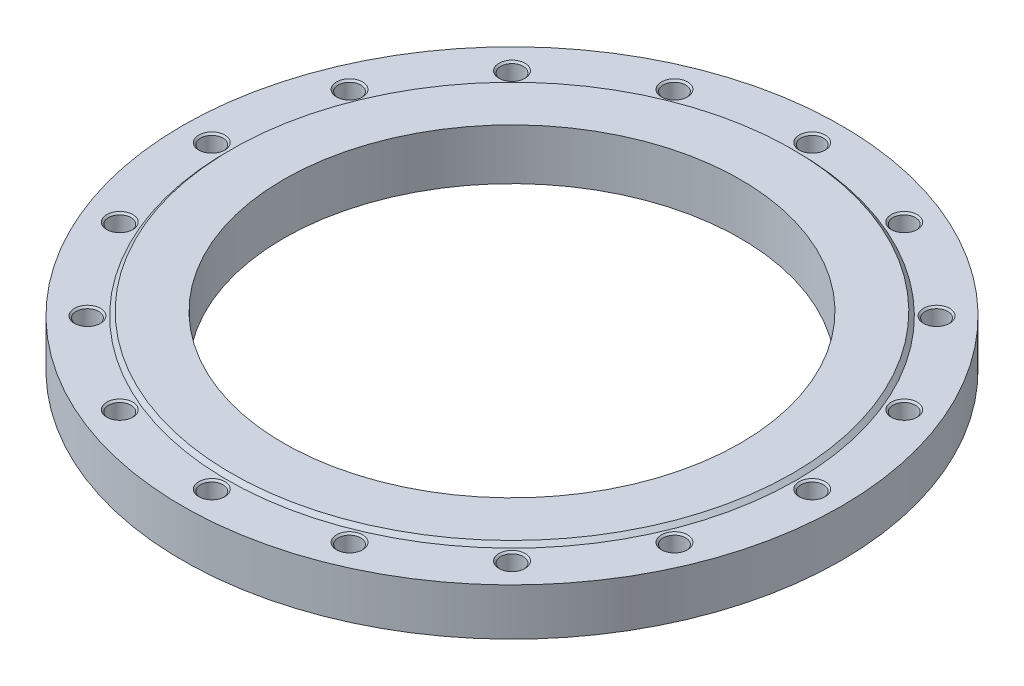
ISO-10303-21;
HEADER;
FILE_DESCRIPTION(('STEP AP214'),'2;1');
FILE_NAME('part.step','',(''),(''),'','','');
FILE_SCHEMA(('AUTOMOTIVE_DESIGN { 1 0 10303 214 1 1 1 1 }'));
ENDSEC;
DATA;
#1=APPLICATION_CONTEXT('core data for automotive mechanical design processes');
#2=APPLICATION_PROTOCOL_DEFINITION('international standard','automotive_design',2000,#1);
#3=PRODUCT_CONTEXT('',#1,'mechanical');
#4=PRODUCT('Part','Part','',(#3));
#5=PRODUCT_RELATED_PRODUCT_CATEGORY('part','',(#4));
#6=PRODUCT_DEFINITION_FORMATION('','',#4);
#7=PRODUCT_DEFINITION_CONTEXT('part definition',#1,'design');
#8=PRODUCT_DEFINITION('design','',#6,#7);
#9=PRODUCT_DEFINITION_SHAPE('','',#8);
#10=(LENGTH_UNIT() NAMED_UNIT(*) SI_UNIT(.MILLI.,.METRE.));
#11=(NAMED_UNIT(*) PLANE_ANGLE_UNIT() SI_UNIT($,.RADIAN.));
#12=(NAMED_UNIT(*) SI_UNIT($,.STERADIAN.) SOLID_ANGLE_UNIT());
#13=UNCERTAINTY_MEASURE_WITH_UNIT(LENGTH_MEASURE(1.E-05),#10,'distance_accuracy_value','');
#14=(GEOMETRIC_REPRESENTATION_CONTEXT(3) GLOBAL_UNCERTAINTY_ASSIGNED_CONTEXT((#13)) GLOBAL_UNIT_ASSIGNED_CONTEXT((#10,
#11,#12)) REPRESENTATION_CONTEXT('',''));
#15=CARTESIAN_POINT('',(0.,0.,0.));
#16=DIRECTION('',(0.,0.,1.));
#17=DIRECTION('',(1.,0.,0.));
#18=AXIS2_PLACEMENT_3D('',#15,#16,#17);
#19=CARTESIAN_POINT('',(0.,18.,0.));
#20=DIRECTION('',(0.,-1.,0.));
#21=DIRECTION('',(1.,0.,0.));
#22=AXIS2_PLACEMENT_3D('',#19,#20,#21);
#23=CYLINDRICAL_SURFACE('',#22,252.5);
#24=CARTESIAN_POINT('',(0.,0.,0.));
#25=DIRECTION('',(0.,1.,0.));
#26=DIRECTION('',(1.,0.,0.));
#27=AXIS2_PLACEMENT_3D('',#24,#25,#26);
#28=CIRCLE('',#27,252.5);
#29=CARTESIAN_POINT('',(252.5,0.,0.));
#30=VERTEX_POINT('',#29);
#31=EDGE_CURVE('E9',#30,#30,#28,.T.);
#32=ORIENTED_EDGE('',*,*,#31,.T.);
#33=EDGE_LOOP('',(#32));
#34=FACE_BOUND('',#33,.T.);
#35=CARTESIAN_POINT('',(0.,36.,0.));
#36=DIRECTION('',(0.,1.,0.));
#37=DIRECTION('',(1.,0.,0.));
#38=AXIS2_PLACEMENT_3D('',#35,#36,#37);
#39=CIRCLE('',#38,252.5);
#40=CARTESIAN_POINT('',(252.5,36.,0.));
#41=VERTEX_POINT('',#40);
#42=EDGE_CURVE('E122',#41,#41,#39,.T.);
#43=ORIENTED_EDGE('',*,*,#42,.F.);
#44=EDGE_LOOP('',(#43));
#45=FACE_BOUND('',#44,.T.);
#46=ADVANCED_FACE('F15',(#34,#45),#23,.T.);
#47=CARTESIAN_POINT('',(213.75,0.,0.));
#48=DIRECTION('',(0.,-1.,0.));
#49=DIRECTION('',(-1.,0.,0.));
#50=AXIS2_PLACEMENT_3D('',#47,#48,#49);
#51=PLANE('',#50);
#52=CARTESIAN_POINT('',(0.,0.,0.));
#53=DIRECTION('',(0.,1.,0.));
#54=DIRECTION('',(1.,0.,0.));
#55=AXIS2_PLACEMENT_3D('',#52,#53,#54);
#56=CIRCLE('',#55,175.);
#57=CARTESIAN_POINT('',(175.,0.,0.));
#58=VERTEX_POINT('',#57);
#59=EDGE_CURVE('E24',#58,#58,#56,.T.);
#60=ORIENTED_EDGE('',*,*,#59,.T.);
#61=EDGE_LOOP('',(#60));
#62=FACE_BOUND('',#61,.T.);
#63=ORIENTED_EDGE('',*,*,#31,.F.);
#64=EDGE_LOOP('',(#63));
#65=FACE_BOUND('',#64,.T.);
#66=ADVANCED_FACE('F17',(#62,#65),#51,.T.);
#67=CARTESIAN_POINT('',(0.,19.5,0.));
#68=DIRECTION('',(0.,-1.,0.));
#69=DIRECTION('',(1.,0.,0.));
#70=AXIS2_PLACEMENT_3D('',#67,#68,#69);
#71=CYLINDRICAL_SURFACE('',#70,175.);
#72=CARTESIAN_POINT('',(0.,39.,0.));
#73=DIRECTION('',(0.,1.,0.));
#74=DIRECTION('',(1.,0.,0.));
#75=AXIS2_PLACEMENT_3D('',#72,#73,#74);
#76=CIRCLE('',#75,175.);
#77=CARTESIAN_POINT('',(175.,39.,0.));
#78=VERTEX_POINT('',#77);
#79=EDGE_CURVE('E116',#78,#78,#76,.T.);
#80=ORIENTED_EDGE('',*,*,#79,.T.);
#81=EDGE_LOOP('',(#80));
#82=FACE_BOUND('',#81,.T.);
#83=ORIENTED_EDGE('',*,*,#59,.F.);
#84=EDGE_LOOP('',(#83));
#85=FACE_BOUND('',#84,.T.);
#86=ADVANCED_FACE('F117',(#82,#85),#71,.F.);
#87=CARTESIAN_POINT('',(195.,39.,0.));
#88=DIRECTION('',(0.,1.,0.));
#89=DIRECTION('',(1.,0.,0.));
#90=AXIS2_PLACEMENT_3D('',#87,#88,#89);
#91=PLANE('',#90);
#92=CARTESIAN_POINT('',(0.,39.,0.));
#93=DIRECTION('',(0.,1.,0.));
#94=DIRECTION('',(1.,0.,0.));
#95=AXIS2_PLACEMENT_3D('',#92,#93,#94);
#96=CIRCLE('',#95,215.);
#97=CARTESIAN_POINT('',(215.,39.,0.));
#98=VERTEX_POINT('',#97);
#99=EDGE_CURVE('E112',#98,#98,#96,.T.);
#100=ORIENTED_EDGE('',*,*,#99,.T.);
#101=EDGE_LOOP('',(#100));
#102=FACE_BOUND('',#101,.T.);
#103=ORIENTED_EDGE('',*,*,#79,.F.);
#104=EDGE_LOOP('',(#103));
#105=FACE_BOUND('',#104,.T.);
#106=ADVANCED_FACE('F600',(#102,#105),#91,.T.);
#107=CARTESIAN_POINT('',(0.,37.5,0.));
#108=DIRECTION('',(0.,-1.,0.));
#109=DIRECTION('',(1.,0.,0.));
#110=AXIS2_PLACEMENT_3D('',#107,#108,#109);
#111=CONICAL_SURFACE('',#110,216.5,0.785398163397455);
#112=CARTESIAN_POINT('',(0.,36.,0.));
#113=DIRECTION('',(0.,1.,0.));
#114=DIRECTION('',(1.,0.,0.));
#115=AXIS2_PLACEMENT_3D('',#112,#113,#114);
#116=CIRCLE('',#115,218.);
#117=CARTESIAN_POINT('',(218.,36.,0.));
#118=VERTEX_POINT('',#117);
#119=EDGE_CURVE('E323',#118,#118,#116,.T.);
#120=ORIENTED_EDGE('',*,*,#119,.T.);
#121=EDGE_LOOP('',(#120));
#122=FACE_BOUND('',#121,.T.);
#123=ORIENTED_EDGE('',*,*,#99,.F.);
#124=EDGE_LOOP('',(#123));
#125=FACE_BOUND('',#124,.T.);
#126=ADVANCED_FACE('F528',(#122,#125),#111,.T.);
#127=CARTESIAN_POINT('',(235.25,36.,0.));
#128=DIRECTION('',(0.,1.,0.));
#129=DIRECTION('',(1.,0.,0.));
#130=AXIS2_PLACEMENT_3D('',#127,#128,#129);
#131=PLANE('',#130);
#132=ORIENTED_EDGE('',*,*,#42,.T.);
#133=EDGE_LOOP('',(#132));
#134=FACE_BOUND('',#133,.T.);
#135=ORIENTED_EDGE('',*,*,#119,.F.);
#136=EDGE_LOOP('',(#135));
#137=FACE_BOUND('',#136,.T.);
#138=CARTESIAN_POINT('',(230.,36.,0.));
#139=DIRECTION('',(0.,-1.,0.));
#140=DIRECTION('',(1.,0.,0.));
#141=AXIS2_PLACEMENT_3D('',#138,#139,#140);
#142=CIRCLE('',#141,10.);
#143=CARTESIAN_POINT('',(240.,36.,0.));
#144=VERTEX_POINT('',#143);
#145=EDGE_CURVE('E316',#144,#144,#142,.T.);
#146=ORIENTED_EDGE('',*,*,#145,.T.);
#147=EDGE_LOOP('',(#146));
#148=FACE_BOUND('',#147,.T.);
#149=CARTESIAN_POINT('',(212.492292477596,36.,-88.0171894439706));
#150=DIRECTION('',(0.,-1.,0.));
#151=DIRECTION('',(0.923879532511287,0.,-0.38268343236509));
#152=AXIS2_PLACEMENT_3D('',#149,#150,#151);
#153=CIRCLE('',#152,10.);
#154=CARTESIAN_POINT('',(221.731087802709,36.,-91.8440237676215));
#155=VERTEX_POINT('',#154);
#156=EDGE_CURVE('E306',#155,#155,#153,.T.);
#157=ORIENTED_EDGE('',*,*,#156,.T.);
#158=EDGE_LOOP('',(#157));
#159=FACE_BOUND('',#158,.T.);
#160=CARTESIAN_POINT('',(162.634559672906,36.,-162.634559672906));
#161=DIRECTION('',(0.,-1.,0.));
#162=DIRECTION('',(0.707106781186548,0.,-0.707106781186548));
#163=AXIS2_PLACEMENT_3D('',#160,#161,#162);
#164=CIRCLE('',#163,10.);
#165=CARTESIAN_POINT('',(169.705627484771,36.,-169.705627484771));
#166=VERTEX_POINT('',#165);
#167=EDGE_CURVE('E257',#166,#166,#164,.T.);
#168=ORIENTED_EDGE('',*,*,#167,.T.);
#169=EDGE_LOOP('',(#168));
#170=FACE_BOUND('',#169,.T.);
#171=CARTESIAN_POINT('',(88.0171894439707,36.,-212.492292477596));
#172=DIRECTION('',(0.,-1.,0.));
#173=DIRECTION('',(0.38268343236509,0.,-0.923879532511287));
#174=AXIS2_PLACEMENT_3D('',#171,#172,#173);
#175=CIRCLE('',#174,10.);
#176=CARTESIAN_POINT('',(91.8440237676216,36.,-221.731087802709));
#177=VERTEX_POINT('',#176);
#178=EDGE_CURVE('E134',#177,#177,#175,.T.);
#179=ORIENTED_EDGE('',*,*,#178,.T.);
#180=EDGE_LOOP('',(#179));
#181=FACE_BOUND('',#180,.T.);
#182=CARTESIAN_POINT('',(0.,36.,-230.));
#183=DIRECTION('',(0.,-1.,0.));
#184=DIRECTION('',(0.,0.,-1.));
#185=AXIS2_PLACEMENT_3D('',#182,#183,#184);
#186=CIRCLE('',#185,10.);
#187=CARTESIAN_POINT('',(0.,36.,-240.));
#188=VERTEX_POINT('',#187);
#189=EDGE_CURVE('E146',#188,#188,#186,.T.);
#190=ORIENTED_EDGE('',*,*,#189,.T.);
#191=EDGE_LOOP('',(#190));
#192=FACE_BOUND('',#191,.T.);
#193=CARTESIAN_POINT('',(-88.0171894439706,36.,-212.492292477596));
#194=DIRECTION('',(0.,-1.,0.));
#195=DIRECTION('',(-0.38268343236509,0.,-0.923879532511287));
#196=AXIS2_PLACEMENT_3D('',#193,#194,#195);
#197=CIRCLE('',#196,10.);
#198=CARTESIAN_POINT('',(-91.8440237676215,36.,-221.731087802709));
#199=VERTEX_POINT('',#198);
#200=EDGE_CURVE('E258',#199,#199,#197,.T.);
#201=ORIENTED_EDGE('',*,*,#200,.T.);
#202=EDGE_LOOP('',(#201));
#203=FACE_BOUND('',#202,.T.);
#204=CARTESIAN_POINT('',(-162.634559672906,36.,-162.634559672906));
#205=DIRECTION('',(0.,-1.,0.));
#206=DIRECTION('',(-0.707106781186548,0.,-0.707106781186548));
#207=AXIS2_PLACEMENT_3D('',#204,#205,#206);
#208=CIRCLE('',#207,10.);
#209=CARTESIAN_POINT('',(-169.705627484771,36.,-169.705627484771));
#210=VERTEX_POINT('',#209);
#211=EDGE_CURVE('E240',#210,#210,#208,.T.);
#212=ORIENTED_EDGE('',*,*,#211,.T.);
#213=EDGE_LOOP('',(#212));
#214=FACE_BOUND('',#213,.T.);
#215=CARTESIAN_POINT('',(-212.492292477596,36.,-88.0171894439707));
#216=DIRECTION('',(0.,-1.,0.));
#217=DIRECTION('',(-0.923879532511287,0.,-0.38268343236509));
#218=AXIS2_PLACEMENT_3D('',#215,#216,#217);
#219=CIRCLE('',#218,10.);
#220=CARTESIAN_POINT('',(-221.731087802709,36.,-91.8440237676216));
#221=VERTEX_POINT('',#220);
#222=EDGE_CURVE('E224',#221,#221,#219,.T.);
#223=ORIENTED_EDGE('',*,*,#222,.T.);
#224=EDGE_LOOP('',(#223));
#225=FACE_BOUND('',#224,.T.);
#226=CARTESIAN_POINT('',(-230.,36.,0.));
#227=DIRECTION('',(0.,-1.,0.));
#228=DIRECTION('',(-1.,0.,0.));
#229=AXIS2_PLACEMENT_3D('',#226,#227,#228);
#230=CIRCLE('',#229,10.);
#231=CARTESIAN_POINT('',(-240.,36.,0.));
#232=VERTEX_POINT('',#231);
#233=EDGE_CURVE('E175',#232,#232,#230,.T.);
#234=ORIENTED_EDGE('',*,*,#233,.T.);
#235=EDGE_LOOP('',(#234));
#236=FACE_BOUND('',#235,.T.);
#237=CARTESIAN_POINT('',(-212.492292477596,36.,88.0171894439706));
#238=DIRECTION('',(0.,-1.,0.));
#239=DIRECTION('',(-0.923879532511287,0.,0.38268343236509));
#240=AXIS2_PLACEMENT_3D('',#237,#238,#239);
#241=CIRCLE('',#240,10.);
#242=CARTESIAN_POINT('',(-221.731087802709,36.,91.8440237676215));
#243=VERTEX_POINT('',#242);
#244=EDGE_CURVE('E195',#243,#243,#241,.T.);
#245=ORIENTED_EDGE('',*,*,#244,.T.);
#246=EDGE_LOOP('',(#245));
#247=FACE_BOUND('',#246,.T.);
#248=CARTESIAN_POINT('',(-162.634559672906,36.,162.634559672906));
#249=DIRECTION('',(0.,-1.,0.));
#250=DIRECTION('',(-0.707106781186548,0.,0.707106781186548));
#251=AXIS2_PLACEMENT_3D('',#248,#249,#250);
#252=CIRCLE('',#251,10.);
#253=CARTESIAN_POINT('',(-169.705627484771,36.,169.705627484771));
#254=VERTEX_POINT('',#253);
#255=EDGE_CURVE('E168',#254,#254,#252,.T.);
#256=ORIENTED_EDGE('',*,*,#255,.T.);
#257=EDGE_LOOP('',(#256));
#258=FACE_BOUND('',#257,.T.);
#259=CARTESIAN_POINT('',(-88.0171894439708,36.,212.492292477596));
#260=DIRECTION('',(0.,-1.,0.));
#261=DIRECTION('',(-0.382683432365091,0.,0.923879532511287));
#262=AXIS2_PLACEMENT_3D('',#259,#260,#261);
#263=CIRCLE('',#262,10.);
#264=CARTESIAN_POINT('',(-91.8440237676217,36.,221.731087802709));
#265=VERTEX_POINT('',#264);
#266=EDGE_CURVE('E145',#265,#265,#263,.T.);
#267=ORIENTED_EDGE('',*,*,#266,.T.);
#268=EDGE_LOOP('',(#267));
#269=FACE_BOUND('',#268,.T.);
#270=CARTESIAN_POINT('',(0.,36.,230.));
#271=DIRECTION('',(0.,-1.,0.));
#272=DIRECTION('',(0.,0.,1.));
#273=AXIS2_PLACEMENT_3D('',#270,#271,#272);
#274=CIRCLE('',#273,10.);
#275=CARTESIAN_POINT('',(0.,36.,240.));
#276=VERTEX_POINT('',#275);
#277=EDGE_CURVE('E126',#276,#276,#274,.T.);
#278=ORIENTED_EDGE('',*,*,#277,.T.);
#279=EDGE_LOOP('',(#278));
#280=FACE_BOUND('',#279,.T.);
#281=CARTESIAN_POINT('',(88.0171894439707,36.,212.492292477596));
#282=DIRECTION('',(0.,-1.,0.));
#283=DIRECTION('',(0.38268343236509,0.,0.923879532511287));
#284=AXIS2_PLACEMENT_3D('',#281,#282,#283);
#285=CIRCLE('',#284,10.);
#286=CARTESIAN_POINT('',(91.8440237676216,36.,221.731087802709));
#287=VERTEX_POINT('',#286);
#288=EDGE_CURVE('E1379',#287,#287,#285,.T.);
#289=ORIENTED_EDGE('',*,*,#288,.T.);
#290=EDGE_LOOP('',(#289));
#291=FACE_BOUND('',#290,.T.);
#292=CARTESIAN_POINT('',(162.634559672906,36.,162.634559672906));
#293=DIRECTION('',(0.,-1.,0.));
#294=DIRECTION('',(0.707106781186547,0.,0.707106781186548));
#295=AXIS2_PLACEMENT_3D('',#292,#293,#294);
#296=CIRCLE('',#295,10.);
#297=CARTESIAN_POINT('',(169.705627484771,36.,169.705627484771));
#298=VERTEX_POINT('',#297);
#299=EDGE_CURVE('E1389',#298,#298,#296,.T.);
#300=ORIENTED_EDGE('',*,*,#299,.T.);
#301=EDGE_LOOP('',(#300));
#302=FACE_BOUND('',#301,.T.);
#303=CARTESIAN_POINT('',(212.492292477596,36.,88.0171894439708));
#304=DIRECTION('',(0.,-1.,0.));
#305=DIRECTION('',(0.923879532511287,0.,0.382683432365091));
#306=AXIS2_PLACEMENT_3D('',#303,#304,#305);
#307=CIRCLE('',#306,10.);
#308=CARTESIAN_POINT('',(221.731087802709,36.,91.8440237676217));
#309=VERTEX_POINT('',#308);
#310=EDGE_CURVE('E1352',#309,#309,#307,.T.);
#311=ORIENTED_EDGE('',*,*,#310,.T.);
#312=EDGE_LOOP('',(#311));
#313=FACE_BOUND('',#312,.T.);
#314=ADVANCED_FACE('F327',(#134,#137,#148,#159,#170,#181,#192,#203,#214,#225,#236,#247,#258,
#269,#280,#291,#302,#313),#131,.T.);
#315=CARTESIAN_POINT('',(230.,5.50386219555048,0.));
#316=DIRECTION('',(0.,1.,0.));
#317=DIRECTION('',(1.,0.,0.));
#318=AXIS2_PLACEMENT_3D('',#315,#316,#317);
#319=CONICAL_SURFACE('',#318,4.3234375,1.0471975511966);
#320=CARTESIAN_POINT('',(230.,8.,0.));
#321=DIRECTION('',(0.,-1.,0.));
#322=DIRECTION('',(1.,0.,0.));
#323=AXIS2_PLACEMENT_3D('',#320,#321,#322);
#324=CIRCLE('',#323,8.646875);
#325=CARTESIAN_POINT('',(238.646875,8.,0.));
#326=VERTEX_POINT('',#325);
#327=EDGE_CURVE('E185',#326,#326,#324,.T.);
#328=ORIENTED_EDGE('',*,*,#327,.F.);
#329=EDGE_LOOP('',(#328));
#330=FACE_BOUND('',#329,.T.);
#331=CARTESIAN_POINT('',(230.,3.00772439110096,0.));
#332=VERTEX_POINT('',#331);
#333=VERTEX_LOOP('',#332);
#334=FACE_BOUND('',#333,.T.);
#335=ADVANCED_FACE('F454',(#330,#334),#319,.F.);
#336=CARTESIAN_POINT('',(230.,11.3234375,0.));
#337=DIRECTION('',(0.,1.,0.));
#338=DIRECTION('',(1.,0.,0.));
#339=AXIS2_PLACEMENT_3D('',#336,#337,#338);
#340=CYLINDRICAL_SURFACE('',#339,8.646875);
#341=CARTESIAN_POINT('',(230.,14.646875,0.));
#342=DIRECTION('',(0.,-1.,0.));
#343=DIRECTION('',(1.,0.,0.));
#344=AXIS2_PLACEMENT_3D('',#341,#342,#343);
#345=CIRCLE('',#344,8.646875);
#346=CARTESIAN_POINT('',(238.646875,14.646875,0.));
#347=VERTEX_POINT('',#346);
#348=EDGE_CURVE('E183',#347,#347,#345,.T.);
#349=ORIENTED_EDGE('',*,*,#348,.F.);
#350=EDGE_LOOP('',(#349));
#351=FACE_BOUND('',#350,.T.);
#352=ORIENTED_EDGE('',*,*,#327,.T.);
#353=EDGE_LOOP('',(#352));
#354=FACE_BOUND('',#353,.T.);
#355=ADVANCED_FACE('F457',(#351,#354),#340,.F.);
#356=CARTESIAN_POINT('',(230.,15.3234375,0.));
#357=DIRECTION('',(0.,1.,0.));
#358=DIRECTION('',(1.,0.,0.));
#359=AXIS2_PLACEMENT_3D('',#356,#357,#358);
#360=CONICAL_SURFACE('',#359,9.3234375,0.785398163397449);
#361=CARTESIAN_POINT('',(230.,16.,0.));
#362=DIRECTION('',(0.,-1.,0.));
#363=DIRECTION('',(1.,0.,0.));
#364=AXIS2_PLACEMENT_3D('',#361,#362,#363);
#365=CIRCLE('',#364,10.);
#366=CARTESIAN_POINT('',(240.,16.,0.));
#367=VERTEX_POINT('',#366);
#368=EDGE_CURVE('E186',#367,#367,#365,.T.);
#369=ORIENTED_EDGE('',*,*,#368,.F.);
#370=EDGE_LOOP('',(#369));
#371=FACE_BOUND('',#370,.T.);
#372=ORIENTED_EDGE('',*,*,#348,.T.);
#373=EDGE_LOOP('',(#372));
#374=FACE_BOUND('',#373,.T.);
#375=ADVANCED_FACE('F467',(#371,#374),#360,.F.);
#376=CARTESIAN_POINT('',(239.3234375,16.,0.));
#377=DIRECTION('',(0.,1.,0.));
#378=DIRECTION('',(-1.,0.,0.));
#379=AXIS2_PLACEMENT_3D('',#376,#377,#378);
#380=PLANE('',#379);
#381=CARTESIAN_POINT('',(230.,16.,0.));
#382=DIRECTION('',(0.,-1.,0.));
#383=DIRECTION('',(1.,0.,0.));
#384=AXIS2_PLACEMENT_3D('',#381,#382,#383);
#385=CIRCLE('',#384,8.646875);
#386=CARTESIAN_POINT('',(238.646875,16.,0.));
#387=VERTEX_POINT('',#386);
#388=EDGE_CURVE('E319',#387,#387,#385,.T.);
#389=ORIENTED_EDGE('',*,*,#388,.F.);
#390=EDGE_LOOP('',(#389));
#391=FACE_BOUND('',#390,.T.);
#392=ORIENTED_EDGE('',*,*,#368,.T.);
#393=EDGE_LOOP('',(#392));
#394=FACE_BOUND('',#393,.T.);
#395=ADVANCED_FACE('F470',(#391,#394),#380,.F.);
#396=CARTESIAN_POINT('',(230.,25.3234375,0.));
#397=DIRECTION('',(0.,1.,0.));
#398=DIRECTION('',(1.,0.,0.));
#399=AXIS2_PLACEMENT_3D('',#396,#397,#398);
#400=CYLINDRICAL_SURFACE('',#399,8.646875);
#401=CARTESIAN_POINT('',(230.,34.646875,0.));
#402=DIRECTION('',(0.,-1.,0.));
#403=DIRECTION('',(1.,0.,0.));
#404=AXIS2_PLACEMENT_3D('',#401,#402,#403);
#405=CIRCLE('',#404,8.646875);
#406=CARTESIAN_POINT('',(238.646875,34.646875,0.));
#407=VERTEX_POINT('',#406);
#408=EDGE_CURVE('E314',#407,#407,#405,.T.);
#409=ORIENTED_EDGE('',*,*,#408,.F.);
#410=EDGE_LOOP('',(#409));
#411=FACE_BOUND('',#410,.T.);
#412=ORIENTED_EDGE('',*,*,#388,.T.);
#413=EDGE_LOOP('',(#412));
#414=FACE_BOUND('',#413,.T.);
#415=ADVANCED_FACE('F480',(#411,#414),#400,.F.);
#416=CARTESIAN_POINT('',(230.,35.3234375,0.));
#417=DIRECTION('',(0.,1.,0.));
#418=DIRECTION('',(1.,0.,0.));
#419=AXIS2_PLACEMENT_3D('',#416,#417,#418);
#420=CONICAL_SURFACE('',#419,9.3234375,0.785398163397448);
#421=ORIENTED_EDGE('',*,*,#145,.F.);
#422=EDGE_LOOP('',(#421));
#423=FACE_BOUND('',#422,.T.);
#424=ORIENTED_EDGE('',*,*,#408,.T.);
#425=EDGE_LOOP('',(#424));
#426=FACE_BOUND('',#425,.T.);
#427=ADVANCED_FACE('F380',(#423,#426),#420,.F.);
#428=CARTESIAN_POINT('',(212.492292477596,5.50386219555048,-88.0171894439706));
#429=DIRECTION('',(0.,1.,0.));
#430=DIRECTION('',(0.923879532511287,0.,-0.38268343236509));
#431=AXIS2_PLACEMENT_3D('',#428,#429,#430);
#432=CONICAL_SURFACE('',#431,4.3234375,1.0471975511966);
#433=CARTESIAN_POINT('',(212.492292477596,8.,-88.0171894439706));
#434=DIRECTION('',(0.,-1.,0.));
#435=DIRECTION('',(0.923879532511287,0.,-0.38268343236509));
#436=AXIS2_PLACEMENT_3D('',#433,#434,#435);
#437=CIRCLE('',#436,8.646875);
#438=CARTESIAN_POINT('',(220.480963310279,8.,-91.3262052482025));
#439=VERTEX_POINT('',#438);
#440=EDGE_CURVE('E311',#439,#439,#437,.T.);
#441=ORIENTED_EDGE('',*,*,#440,.F.);
#442=EDGE_LOOP('',(#441));
#443=FACE_BOUND('',#442,.T.);
#444=CARTESIAN_POINT('',(212.492292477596,3.00772439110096,-88.0171894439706));
#445=VERTEX_POINT('',#444);
#446=VERTEX_LOOP('',#445);
#447=FACE_BOUND('',#446,.T.);
#448=ADVANCED_FACE('F376',(#443,#447),#432,.F.);
#449=CARTESIAN_POINT('',(212.492292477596,11.3234375,-88.0171894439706));
#450=DIRECTION('',(0.,1.,0.));
#451=DIRECTION('',(0.923879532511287,0.,-0.38268343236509));
#452=AXIS2_PLACEMENT_3D('',#449,#450,#451);
#453=CYLINDRICAL_SURFACE('',#452,8.646875);
#454=CARTESIAN_POINT('',(212.492292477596,14.646875,-88.0171894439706));
#455=DIRECTION('',(0.,-1.,0.));
#456=DIRECTION('',(0.923879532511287,0.,-0.38268343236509));
#457=AXIS2_PLACEMENT_3D('',#454,#455,#456);
#458=CIRCLE('',#457,8.646875);
#459=CARTESIAN_POINT('',(220.480963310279,14.646875,-91.3262052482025));
#460=VERTEX_POINT('',#459);
#461=EDGE_CURVE('E291',#460,#460,#458,.T.);
#462=ORIENTED_EDGE('',*,*,#461,.F.);
#463=EDGE_LOOP('',(#462));
#464=FACE_BOUND('',#463,.T.);
#465=ORIENTED_EDGE('',*,*,#440,.T.);
#466=EDGE_LOOP('',(#465));
#467=FACE_BOUND('',#466,.T.);
#468=ADVANCED_FACE('F379',(#464,#467),#453,.F.);
#469=CARTESIAN_POINT('',(212.492292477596,15.3234375,-88.0171894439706));
#470=DIRECTION('',(0.,1.,0.));
#471=DIRECTION('',(0.923879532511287,0.,-0.38268343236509));
#472=AXIS2_PLACEMENT_3D('',#469,#470,#471);
#473=CONICAL_SURFACE('',#472,9.3234375,0.785398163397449);
#474=CARTESIAN_POINT('',(212.492292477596,16.,-88.0171894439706));
#475=DIRECTION('',(0.,-1.,0.));
#476=DIRECTION('',(0.923879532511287,0.,-0.38268343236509));
#477=AXIS2_PLACEMENT_3D('',#474,#475,#476);
#478=CIRCLE('',#477,10.);
#479=CARTESIAN_POINT('',(221.731087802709,16.,-91.8440237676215));
#480=VERTEX_POINT('',#479);
#481=EDGE_CURVE('E289',#480,#480,#478,.T.);
#482=ORIENTED_EDGE('',*,*,#481,.F.);
#483=EDGE_LOOP('',(#482));
#484=FACE_BOUND('',#483,.T.);
#485=ORIENTED_EDGE('',*,*,#461,.T.);
#486=EDGE_LOOP('',(#485));
#487=FACE_BOUND('',#486,.T.);
#488=ADVANCED_FACE('F391',(#484,#487),#473,.F.);
#489=CARTESIAN_POINT('',(221.106025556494,16.,-91.585114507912));
#490=DIRECTION('',(0.,1.,0.));
#491=DIRECTION('',(-0.923879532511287,0.,0.38268343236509));
#492=AXIS2_PLACEMENT_3D('',#489,#490,#491);
#493=PLANE('',#492);
#494=CARTESIAN_POINT('',(212.492292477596,16.,-88.0171894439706));
#495=DIRECTION('',(0.,-1.,0.));
#496=DIRECTION('',(0.923879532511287,0.,-0.38268343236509));
#497=AXIS2_PLACEMENT_3D('',#494,#495,#496);
#498=CIRCLE('',#497,8.646875);
#499=CARTESIAN_POINT('',(220.480963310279,16.,-91.3262052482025));
#500=VERTEX_POINT('',#499);
#501=EDGE_CURVE('E292',#500,#500,#498,.T.);
#502=ORIENTED_EDGE('',*,*,#501,.F.);
#503=EDGE_LOOP('',(#502));
#504=FACE_BOUND('',#503,.T.);
#505=ORIENTED_EDGE('',*,*,#481,.T.);
#506=EDGE_LOOP('',(#505));
#507=FACE_BOUND('',#506,.T.);
#508=ADVANCED_FACE('F394',(#504,#507),#493,.F.);
#509=CARTESIAN_POINT('',(212.492292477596,25.3234375,-88.0171894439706));
#510=DIRECTION('',(0.,1.,0.));
#511=DIRECTION('',(0.923879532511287,0.,-0.38268343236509));
#512=AXIS2_PLACEMENT_3D('',#509,#510,#511);
#513=CYLINDRICAL_SURFACE('',#512,8.646875);
#514=CARTESIAN_POINT('',(212.492292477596,34.646875,-88.0171894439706));
#515=DIRECTION('',(0.,-1.,0.));
#516=DIRECTION('',(0.923879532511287,0.,-0.38268343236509));
#517=AXIS2_PLACEMENT_3D('',#514,#515,#516);
#518=CIRCLE('',#517,8.646875);
#519=CARTESIAN_POINT('',(220.480963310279,34.646875,-91.3262052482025));
#520=VERTEX_POINT('',#519);
#521=EDGE_CURVE('E305',#520,#520,#518,.T.);
#522=ORIENTED_EDGE('',*,*,#521,.F.);
#523=EDGE_LOOP('',(#522));
#524=FACE_BOUND('',#523,.T.);
#525=ORIENTED_EDGE('',*,*,#501,.T.);
#526=EDGE_LOOP('',(#525));
#527=FACE_BOUND('',#526,.T.);
#528=ADVANCED_FACE('F514',(#524,#527),#513,.F.);
#529=CARTESIAN_POINT('',(212.492292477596,35.3234375,-88.0171894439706));
#530=DIRECTION('',(0.,1.,0.));
#531=DIRECTION('',(0.923879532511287,0.,-0.38268343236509));
#532=AXIS2_PLACEMENT_3D('',#529,#530,#531);
#533=CONICAL_SURFACE('',#532,9.3234375,0.785398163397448);
#534=ORIENTED_EDGE('',*,*,#156,.F.);
#535=EDGE_LOOP('',(#534));
#536=FACE_BOUND('',#535,.T.);
#537=ORIENTED_EDGE('',*,*,#521,.T.);
#538=EDGE_LOOP('',(#537));
#539=FACE_BOUND('',#538,.T.);
#540=ADVANCED_FACE('F657',(#536,#539),#533,.F.);
#541=CARTESIAN_POINT('',(162.634559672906,5.50386219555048,-162.634559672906));
#542=DIRECTION('',(0.,1.,0.));
#543=DIRECTION('',(0.707106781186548,0.,-0.707106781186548));
#544=AXIS2_PLACEMENT_3D('',#541,#542,#543);
#545=CONICAL_SURFACE('',#544,4.3234375,1.0471975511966);
#546=CARTESIAN_POINT('',(162.634559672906,8.,-162.634559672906));
#547=DIRECTION('',(0.,-1.,0.));
#548=DIRECTION('',(0.707106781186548,0.,-0.707106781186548));
#549=AXIS2_PLACEMENT_3D('',#546,#547,#548);
#550=CIRCLE('',#549,8.646875);
#551=CARTESIAN_POINT('',(168.748823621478,8.,-168.748823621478));
#552=VERTEX_POINT('',#551);
#553=EDGE_CURVE('E302',#552,#552,#550,.T.);
#554=ORIENTED_EDGE('',*,*,#553,.F.);
#555=EDGE_LOOP('',(#554));
#556=FACE_BOUND('',#555,.T.);
#557=CARTESIAN_POINT('',(162.634559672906,3.00772439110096,-162.634559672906));
#558=VERTEX_POINT('',#557);
#559=VERTEX_LOOP('',#558);
#560=FACE_BOUND('',#559,.T.);
#561=ADVANCED_FACE('F616',(#556,#560),#545,.F.);
#562=CARTESIAN_POINT('',(162.634559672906,11.3234375,-162.634559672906));
#563=DIRECTION('',(0.,1.,0.));
#564=DIRECTION('',(0.707106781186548,0.,-0.707106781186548));
#565=AXIS2_PLACEMENT_3D('',#562,#563,#564);
#566=CYLINDRICAL_SURFACE('',#565,8.646875);
#567=CARTESIAN_POINT('',(162.634559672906,14.646875,-162.634559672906));
#568=DIRECTION('',(0.,-1.,0.));
#569=DIRECTION('',(0.707106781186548,0.,-0.707106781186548));
#570=AXIS2_PLACEMENT_3D('',#567,#568,#569);
#571=CIRCLE('',#570,8.646875);
#572=CARTESIAN_POINT('',(168.748823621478,14.646875,-168.748823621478));
#573=VERTEX_POINT('',#572);
#574=EDGE_CURVE('E264',#573,#573,#571,.T.);
#575=ORIENTED_EDGE('',*,*,#574,.F.);
#576=EDGE_LOOP('',(#575));
#577=FACE_BOUND('',#576,.T.);
#578=ORIENTED_EDGE('',*,*,#553,.T.);
#579=EDGE_LOOP('',(#578));
#580=FACE_BOUND('',#579,.T.);
#581=ADVANCED_FACE('F613',(#577,#580),#566,.F.);
#582=CARTESIAN_POINT('',(162.634559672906,15.3234375,-162.634559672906));
#583=DIRECTION('',(0.,1.,0.));
#584=DIRECTION('',(0.707106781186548,0.,-0.707106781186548));
#585=AXIS2_PLACEMENT_3D('',#582,#583,#584);
#586=CONICAL_SURFACE('',#585,9.3234375,0.785398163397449);
#587=CARTESIAN_POINT('',(162.634559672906,16.,-162.634559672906));
#588=DIRECTION('',(0.,-1.,0.));
#589=DIRECTION('',(0.707106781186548,0.,-0.707106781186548));
#590=AXIS2_PLACEMENT_3D('',#587,#588,#589);
#591=CIRCLE('',#590,10.);
#592=CARTESIAN_POINT('',(169.705627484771,16.,-169.705627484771));
#593=VERTEX_POINT('',#592);
#594=EDGE_CURVE('E256',#593,#593,#591,.T.);
#595=ORIENTED_EDGE('',*,*,#594,.F.);
#596=EDGE_LOOP('',(#595));
#597=FACE_BOUND('',#596,.T.);
#598=ORIENTED_EDGE('',*,*,#574,.T.);
#599=EDGE_LOOP('',(#598));
#600=FACE_BOUND('',#599,.T.);
#601=ADVANCED_FACE('F438',(#597,#600),#586,.F.);
#602=CARTESIAN_POINT('',(169.227225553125,16.,-169.227225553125));
#603=DIRECTION('',(0.,1.,0.));
#604=DIRECTION('',(-0.707106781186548,0.,0.707106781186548));
#605=AXIS2_PLACEMENT_3D('',#602,#603,#604);
#606=PLANE('',#605);
#607=CARTESIAN_POINT('',(162.634559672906,16.,-162.634559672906));
#608=DIRECTION('',(0.,-1.,0.));
#609=DIRECTION('',(0.707106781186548,0.,-0.707106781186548));
#610=AXIS2_PLACEMENT_3D('',#607,#608,#609);
#611=CIRCLE('',#610,8.646875);
#612=CARTESIAN_POINT('',(168.748823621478,16.,-168.748823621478));
#613=VERTEX_POINT('',#612);
#614=EDGE_CURVE('E254',#613,#613,#611,.T.);
#615=ORIENTED_EDGE('',*,*,#614,.F.);
#616=EDGE_LOOP('',(#615));
#617=FACE_BOUND('',#616,.T.);
#618=ORIENTED_EDGE('',*,*,#594,.T.);
#619=EDGE_LOOP('',(#618));
#620=FACE_BOUND('',#619,.T.);
#621=ADVANCED_FACE('F434',(#617,#620),#606,.F.);
#622=CARTESIAN_POINT('',(162.634559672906,25.3234375,-162.634559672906));
#623=DIRECTION('',(0.,1.,0.));
#624=DIRECTION('',(0.707106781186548,0.,-0.707106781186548));
#625=AXIS2_PLACEMENT_3D('',#622,#623,#624);
#626=CYLINDRICAL_SURFACE('',#625,8.646875);
#627=CARTESIAN_POINT('',(162.634559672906,34.646875,-162.634559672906));
#628=DIRECTION('',(0.,-1.,0.));
#629=DIRECTION('',(0.707106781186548,0.,-0.707106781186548));
#630=AXIS2_PLACEMENT_3D('',#627,#628,#629);
#631=CIRCLE('',#630,8.646875);
#632=CARTESIAN_POINT('',(168.748823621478,34.646875,-168.748823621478));
#633=VERTEX_POINT('',#632);
#634=EDGE_CURVE('E297',#633,#633,#631,.T.);
#635=ORIENTED_EDGE('',*,*,#634,.F.);
#636=EDGE_LOOP('',(#635));
#637=FACE_BOUND('',#636,.T.);
#638=ORIENTED_EDGE('',*,*,#614,.T.);
#639=EDGE_LOOP('',(#638));
#640=FACE_BOUND('',#639,.T.);
#641=ADVANCED_FACE('F437',(#637,#640),#626,.F.);
#642=CARTESIAN_POINT('',(162.634559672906,35.3234375,-162.634559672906));
#643=DIRECTION('',(0.,1.,0.));
#644=DIRECTION('',(0.707106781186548,0.,-0.707106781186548));
#645=AXIS2_PLACEMENT_3D('',#642,#643,#644);
#646=CONICAL_SURFACE('',#645,9.3234375,0.785398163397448);
#647=ORIENTED_EDGE('',*,*,#167,.F.);
#648=EDGE_LOOP('',(#647));
#649=FACE_BOUND('',#648,.T.);
#650=ORIENTED_EDGE('',*,*,#634,.T.);
#651=EDGE_LOOP('',(#650));
#652=FACE_BOUND('',#651,.T.);
#653=ADVANCED_FACE('F644',(#649,#652),#646,.F.);
#654=CARTESIAN_POINT('',(88.0171894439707,5.50386219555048,-212.492292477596));
#655=DIRECTION('',(0.,1.,0.));
#656=DIRECTION('',(0.38268343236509,0.,-0.923879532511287));
#657=AXIS2_PLACEMENT_3D('',#654,#655,#656);
#658=CONICAL_SURFACE('',#657,4.3234375,1.0471975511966);
#659=CARTESIAN_POINT('',(88.0171894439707,8.,-212.492292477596));
#660=DIRECTION('',(0.,-1.,0.));
#661=DIRECTION('',(0.38268343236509,0.,-0.923879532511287));
#662=AXIS2_PLACEMENT_3D('',#659,#660,#661);
#663=CIRCLE('',#662,8.646875);
#664=CARTESIAN_POINT('',(91.3262052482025,8.,-220.480963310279));
#665=VERTEX_POINT('',#664);
#666=EDGE_CURVE('E294',#665,#665,#663,.T.);
#667=ORIENTED_EDGE('',*,*,#666,.F.);
#668=EDGE_LOOP('',(#667));
#669=FACE_BOUND('',#668,.T.);
#670=CARTESIAN_POINT('',(88.0171894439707,3.00772439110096,-212.492292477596));
#671=VERTEX_POINT('',#670);
#672=VERTEX_LOOP('',#671);
#673=FACE_BOUND('',#672,.T.);
#674=ADVANCED_FACE('F640',(#669,#673),#658,.F.);
#675=CARTESIAN_POINT('',(88.0171894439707,11.3234375,-212.492292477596));
#676=DIRECTION('',(0.,1.,0.));
#677=DIRECTION('',(0.38268343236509,0.,-0.923879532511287));
#678=AXIS2_PLACEMENT_3D('',#675,#676,#677);
#679=CYLINDRICAL_SURFACE('',#678,8.646875);
#680=CARTESIAN_POINT('',(88.0171894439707,14.646875,-212.492292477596));
#681=DIRECTION('',(0.,-1.,0.));
#682=DIRECTION('',(0.38268343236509,0.,-0.923879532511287));
#683=AXIS2_PLACEMENT_3D('',#680,#681,#682);
#684=CIRCLE('',#683,8.646875);
#685=CARTESIAN_POINT('',(91.3262052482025,14.646875,-220.480963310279));
#686=VERTEX_POINT('',#685);
#687=EDGE_CURVE('E288',#686,#686,#684,.T.);
#688=ORIENTED_EDGE('',*,*,#687,.F.);
#689=EDGE_LOOP('',(#688));
#690=FACE_BOUND('',#689,.T.);
#691=ORIENTED_EDGE('',*,*,#666,.T.);
#692=EDGE_LOOP('',(#691));
#693=FACE_BOUND('',#692,.T.);
#694=ADVANCED_FACE('F636',(#690,#693),#679,.F.);
#695=CARTESIAN_POINT('',(88.0171894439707,15.3234375,-212.492292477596));
#696=DIRECTION('',(0.,1.,0.));
#697=DIRECTION('',(0.38268343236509,0.,-0.923879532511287));
#698=AXIS2_PLACEMENT_3D('',#695,#696,#697);
#699=CONICAL_SURFACE('',#698,9.3234375,0.785398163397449);
#700=CARTESIAN_POINT('',(88.0171894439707,16.,-212.492292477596));
#701=DIRECTION('',(0.,-1.,0.));
#702=DIRECTION('',(0.38268343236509,0.,-0.923879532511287));
#703=AXIS2_PLACEMENT_3D('',#700,#701,#702);
#704=CIRCLE('',#703,10.);
#705=CARTESIAN_POINT('',(91.8440237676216,16.,-221.731087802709));
#706=VERTEX_POINT('',#705);
#707=EDGE_CURVE('E286',#706,#706,#704,.T.);
#708=ORIENTED_EDGE('',*,*,#707,.F.);
#709=EDGE_LOOP('',(#708));
#710=FACE_BOUND('',#709,.T.);
#711=ORIENTED_EDGE('',*,*,#687,.T.);
#712=EDGE_LOOP('',(#711));
#713=FACE_BOUND('',#712,.T.);
#714=ADVANCED_FACE('F632',(#710,#713),#699,.F.);
#715=CARTESIAN_POINT('',(91.5851145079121,16.,-221.106025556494));
#716=DIRECTION('',(0.,1.,0.));
#717=DIRECTION('',(-0.38268343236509,0.,0.923879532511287));
#718=AXIS2_PLACEMENT_3D('',#715,#716,#717);
#719=PLANE('',#718);
#720=CARTESIAN_POINT('',(88.0171894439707,16.,-212.492292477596));
#721=DIRECTION('',(0.,-1.,0.));
#722=DIRECTION('',(0.38268343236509,0.,-0.923879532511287));
#723=AXIS2_PLACEMENT_3D('',#720,#721,#722);
#724=CIRCLE('',#723,8.646875);
#725=CARTESIAN_POINT('',(91.3262052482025,16.,-220.480963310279));
#726=VERTEX_POINT('',#725);
#727=EDGE_CURVE('E284',#726,#726,#724,.T.);
#728=ORIENTED_EDGE('',*,*,#727,.F.);
#729=EDGE_LOOP('',(#728));
#730=FACE_BOUND('',#729,.T.);
#731=ORIENTED_EDGE('',*,*,#707,.T.);
#732=EDGE_LOOP('',(#731));
#733=FACE_BOUND('',#732,.T.);
#734=ADVANCED_FACE('F628',(#730,#733),#719,.F.);
#735=CARTESIAN_POINT('',(88.0171894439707,25.3234375,-212.492292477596));
#736=DIRECTION('',(0.,1.,0.));
#737=DIRECTION('',(0.38268343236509,0.,-0.923879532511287));
#738=AXIS2_PLACEMENT_3D('',#735,#736,#737);
#739=CYLINDRICAL_SURFACE('',#738,8.646875);
#740=CARTESIAN_POINT('',(88.0171894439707,34.646875,-212.492292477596));
#741=DIRECTION('',(0.,-1.,0.));
#742=DIRECTION('',(0.38268343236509,0.,-0.923879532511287));
#743=AXIS2_PLACEMENT_3D('',#740,#741,#742);
#744=CIRCLE('',#743,8.646875);
#745=CARTESIAN_POINT('',(91.3262052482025,34.646875,-220.480963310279));
#746=VERTEX_POINT('',#745);
#747=EDGE_CURVE('E132',#746,#746,#744,.T.);
#748=ORIENTED_EDGE('',*,*,#747,.F.);
#749=EDGE_LOOP('',(#748));
#750=FACE_BOUND('',#749,.T.);
#751=ORIENTED_EDGE('',*,*,#727,.T.);
#752=EDGE_LOOP('',(#751));
#753=FACE_BOUND('',#752,.T.);
#754=ADVANCED_FACE('F624',(#750,#753),#739,.F.);
#755=CARTESIAN_POINT('',(88.0171894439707,35.3234375,-212.492292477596));
#756=DIRECTION('',(0.,1.,0.));
#757=DIRECTION('',(0.38268343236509,0.,-0.923879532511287));
#758=AXIS2_PLACEMENT_3D('',#755,#756,#757);
#759=CONICAL_SURFACE('',#758,9.3234375,0.785398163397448);
#760=ORIENTED_EDGE('',*,*,#178,.F.);
#761=EDGE_LOOP('',(#760));
#762=FACE_BOUND('',#761,.T.);
#763=ORIENTED_EDGE('',*,*,#747,.T.);
#764=EDGE_LOOP('',(#763));
#765=FACE_BOUND('',#764,.T.);
#766=ADVANCED_FACE('F620',(#762,#765),#759,.F.);
#767=CARTESIAN_POINT('',(0.,5.50386219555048,-230.));
#768=DIRECTION('',(0.,1.,0.));
#769=DIRECTION('',(0.,0.,-1.));
#770=AXIS2_PLACEMENT_3D('',#767,#768,#769);
#771=CONICAL_SURFACE('',#770,4.3234375,1.0471975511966);
#772=CARTESIAN_POINT('',(0.,8.,-230.));
#773=DIRECTION('',(0.,-1.,0.));
#774=DIRECTION('',(0.,0.,-1.));
#775=AXIS2_PLACEMENT_3D('',#772,#773,#774);
#776=CIRCLE('',#775,8.646875);
#777=CARTESIAN_POINT('',(0.,8.,-238.646875));
#778=VERTEX_POINT('',#777);
#779=EDGE_CURVE('E135',#778,#778,#776,.T.);
#780=ORIENTED_EDGE('',*,*,#779,.F.);
#781=EDGE_LOOP('',(#780));
#782=FACE_BOUND('',#781,.T.);
#783=CARTESIAN_POINT('',(0.,3.00772439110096,-230.));
#784=VERTEX_POINT('',#783);
#785=VERTEX_LOOP('',#784);
#786=FACE_BOUND('',#785,.T.);
#787=ADVANCED_FACE('F611',(#782,#786),#771,.F.);
#788=CARTESIAN_POINT('',(0.,11.3234375,-230.));
#789=DIRECTION('',(0.,1.,0.));
#790=DIRECTION('',(0.,0.,-1.));
#791=AXIS2_PLACEMENT_3D('',#788,#789,#790);
#792=CYLINDRICAL_SURFACE('',#791,8.646875);
#793=CARTESIAN_POINT('',(0.,14.646875,-230.));
#794=DIRECTION('',(0.,-1.,0.));
#795=DIRECTION('',(0.,0.,-1.));
#796=AXIS2_PLACEMENT_3D('',#793,#794,#795);
#797=CIRCLE('',#796,8.646875);
#798=CARTESIAN_POINT('',(0.,14.646875,-238.646875));
#799=VERTEX_POINT('',#798);
#800=EDGE_CURVE('E278',#799,#799,#797,.T.);
#801=ORIENTED_EDGE('',*,*,#800,.F.);
#802=EDGE_LOOP('',(#801));
#803=FACE_BOUND('',#802,.T.);
#804=ORIENTED_EDGE('',*,*,#779,.T.);
#805=EDGE_LOOP('',(#804));
#806=FACE_BOUND('',#805,.T.);
#807=ADVANCED_FACE('F507',(#803,#806),#792,.F.);
#808=CARTESIAN_POINT('',(0.,15.3234375,-230.));
#809=DIRECTION('',(0.,1.,0.));
#810=DIRECTION('',(0.,0.,-1.));
#811=AXIS2_PLACEMENT_3D('',#808,#809,#810);
#812=CONICAL_SURFACE('',#811,9.3234375,0.785398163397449);
#813=CARTESIAN_POINT('',(0.,16.,-230.));
#814=DIRECTION('',(0.,-1.,0.));
#815=DIRECTION('',(0.,0.,-1.));
#816=AXIS2_PLACEMENT_3D('',#813,#814,#815);
#817=CIRCLE('',#816,10.);
#818=CARTESIAN_POINT('',(0.,16.,-240.));
#819=VERTEX_POINT('',#818);
#820=EDGE_CURVE('E275',#819,#819,#817,.T.);
#821=ORIENTED_EDGE('',*,*,#820,.F.);
#822=EDGE_LOOP('',(#821));
#823=FACE_BOUND('',#822,.T.);
#824=ORIENTED_EDGE('',*,*,#800,.T.);
#825=EDGE_LOOP('',(#824));
#826=FACE_BOUND('',#825,.T.);
#827=ADVANCED_FACE('F503',(#823,#826),#812,.F.);
#828=CARTESIAN_POINT('',(0.,16.,-239.3234375));
#829=DIRECTION('',(0.,1.,0.));
#830=DIRECTION('',(0.,0.,1.));
#831=AXIS2_PLACEMENT_3D('',#828,#829,#830);
#832=PLANE('',#831);
#833=CARTESIAN_POINT('',(0.,16.,-230.));
#834=DIRECTION('',(0.,-1.,0.));
#835=DIRECTION('',(0.,0.,-1.));
#836=AXIS2_PLACEMENT_3D('',#833,#834,#835);
#837=CIRCLE('',#836,8.646875);
#838=CARTESIAN_POINT('',(0.,16.,-238.646875));
#839=VERTEX_POINT('',#838);
#840=EDGE_CURVE('E149',#839,#839,#837,.T.);
#841=ORIENTED_EDGE('',*,*,#840,.F.);
#842=EDGE_LOOP('',(#841));
#843=FACE_BOUND('',#842,.T.);
#844=ORIENTED_EDGE('',*,*,#820,.T.);
#845=EDGE_LOOP('',(#844));
#846=FACE_BOUND('',#845,.T.);
#847=ADVANCED_FACE('F506',(#843,#846),#832,.F.);
#848=CARTESIAN_POINT('',(0.,25.3234375,-230.));
#849=DIRECTION('',(0.,1.,0.));
#850=DIRECTION('',(0.,0.,-1.));
#851=AXIS2_PLACEMENT_3D('',#848,#849,#850);
#852=CYLINDRICAL_SURFACE('',#851,8.646875);
#853=CARTESIAN_POINT('',(0.,34.646875,-230.));
#854=DIRECTION('',(0.,-1.,0.));
#855=DIRECTION('',(0.,0.,-1.));
#856=AXIS2_PLACEMENT_3D('',#853,#854,#855);
#857=CIRCLE('',#856,8.646875);
#858=CARTESIAN_POINT('',(0.,34.646875,-238.646875));
#859=VERTEX_POINT('',#858);
#860=EDGE_CURVE('E150',#859,#859,#857,.T.);
#861=ORIENTED_EDGE('',*,*,#860,.F.);
#862=EDGE_LOOP('',(#861));
#863=FACE_BOUND('',#862,.T.);
#864=ORIENTED_EDGE('',*,*,#840,.T.);
#865=EDGE_LOOP('',(#864));
#866=FACE_BOUND('',#865,.T.);
#867=ADVANCED_FACE('F518',(#863,#866),#852,.F.);
#868=CARTESIAN_POINT('',(0.,35.3234375,-230.));
#869=DIRECTION('',(0.,1.,0.));
#870=DIRECTION('',(0.,0.,-1.));
#871=AXIS2_PLACEMENT_3D('',#868,#869,#870);
#872=CONICAL_SURFACE('',#871,9.3234375,0.785398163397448);
#873=ORIENTED_EDGE('',*,*,#189,.F.);
#874=EDGE_LOOP('',(#873));
#875=FACE_BOUND('',#874,.T.);
#876=ORIENTED_EDGE('',*,*,#860,.T.);
#877=EDGE_LOOP('',(#876));
#878=FACE_BOUND('',#877,.T.);
#879=ADVANCED_FACE('F598',(#875,#878),#872,.F.);
#880=CARTESIAN_POINT('',(-88.0171894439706,5.50386219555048,-212.492292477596));
#881=DIRECTION('',(0.,1.,0.));
#882=DIRECTION('',(-0.38268343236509,0.,-0.923879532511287));
#883=AXIS2_PLACEMENT_3D('',#880,#881,#882);
#884=CONICAL_SURFACE('',#883,4.3234375,1.0471975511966);
#885=CARTESIAN_POINT('',(-88.0171894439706,8.,-212.492292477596));
#886=DIRECTION('',(0.,-1.,0.));
#887=DIRECTION('',(-0.38268343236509,0.,-0.923879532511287));
#888=AXIS2_PLACEMENT_3D('',#885,#886,#887);
#889=CIRCLE('',#888,8.646875);
#890=CARTESIAN_POINT('',(-91.3262052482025,8.,-220.480963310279));
#891=VERTEX_POINT('',#890);
#892=EDGE_CURVE('E271',#891,#891,#889,.T.);
#893=ORIENTED_EDGE('',*,*,#892,.F.);
#894=EDGE_LOOP('',(#893));
#895=FACE_BOUND('',#894,.T.);
#896=CARTESIAN_POINT('',(-88.0171894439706,3.00772439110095,-212.492292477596));
#897=VERTEX_POINT('',#896);
#898=VERTEX_LOOP('',#897);
#899=FACE_BOUND('',#898,.T.);
#900=ADVANCED_FACE('F594',(#895,#899),#884,.F.);
#901=CARTESIAN_POINT('',(-88.0171894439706,11.3234375,-212.492292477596));
#902=DIRECTION('',(0.,1.,0.));
#903=DIRECTION('',(-0.38268343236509,0.,-0.923879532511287));
#904=AXIS2_PLACEMENT_3D('',#901,#902,#903);
#905=CYLINDRICAL_SURFACE('',#904,8.646875);
#906=CARTESIAN_POINT('',(-88.0171894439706,14.646875,-212.492292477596));
#907=DIRECTION('',(0.,-1.,0.));
#908=DIRECTION('',(-0.38268343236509,0.,-0.923879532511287));
#909=AXIS2_PLACEMENT_3D('',#906,#907,#908);
#910=CIRCLE('',#909,8.646875);
#911=CARTESIAN_POINT('',(-91.3262052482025,14.646875,-220.480963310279));
#912=VERTEX_POINT('',#911);
#913=EDGE_CURVE('E268',#912,#912,#910,.T.);
#914=ORIENTED_EDGE('',*,*,#913,.F.);
#915=EDGE_LOOP('',(#914));
#916=FACE_BOUND('',#915,.T.);
#917=ORIENTED_EDGE('',*,*,#892,.T.);
#918=EDGE_LOOP('',(#917));
#919=FACE_BOUND('',#918,.T.);
#920=ADVANCED_FACE('F591',(#916,#919),#905,.F.);
#921=CARTESIAN_POINT('',(-88.0171894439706,15.3234375,-212.492292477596));
#922=DIRECTION('',(0.,1.,0.));
#923=DIRECTION('',(-0.38268343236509,0.,-0.923879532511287));
#924=AXIS2_PLACEMENT_3D('',#921,#922,#923);
#925=CONICAL_SURFACE('',#924,9.3234375,0.785398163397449);
#926=CARTESIAN_POINT('',(-88.0171894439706,16.,-212.492292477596));
#927=DIRECTION('',(0.,-1.,0.));
#928=DIRECTION('',(-0.38268343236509,0.,-0.923879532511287));
#929=AXIS2_PLACEMENT_3D('',#926,#927,#928);
#930=CIRCLE('',#929,10.);
#931=CARTESIAN_POINT('',(-91.8440237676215,16.,-221.731087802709));
#932=VERTEX_POINT('',#931);
#933=EDGE_CURVE('E265',#932,#932,#930,.T.);
#934=ORIENTED_EDGE('',*,*,#933,.F.);
#935=EDGE_LOOP('',(#934));
#936=FACE_BOUND('',#935,.T.);
#937=ORIENTED_EDGE('',*,*,#913,.T.);
#938=EDGE_LOOP('',(#937));
#939=FACE_BOUND('',#938,.T.);
#940=ADVANCED_FACE('F589',(#936,#939),#925,.F.);
#941=CARTESIAN_POINT('',(-91.585114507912,16.,-221.106025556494));
#942=DIRECTION('',(0.,1.,0.));
#943=DIRECTION('',(0.38268343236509,0.,0.923879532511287));
#944=AXIS2_PLACEMENT_3D('',#941,#942,#943);
#945=PLANE('',#944);
#946=CARTESIAN_POINT('',(-88.0171894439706,16.,-212.492292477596));
#947=DIRECTION('',(0.,-1.,0.));
#948=DIRECTION('',(-0.38268343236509,0.,-0.923879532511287));
#949=AXIS2_PLACEMENT_3D('',#946,#947,#948);
#950=CIRCLE('',#949,8.646875);
#951=CARTESIAN_POINT('',(-91.3262052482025,16.,-220.480963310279));
#952=VERTEX_POINT('',#951);
#953=EDGE_CURVE('E261',#952,#952,#950,.T.);
#954=ORIENTED_EDGE('',*,*,#953,.F.);
#955=EDGE_LOOP('',(#954));
#956=FACE_BOUND('',#955,.T.);
#957=ORIENTED_EDGE('',*,*,#933,.T.);
#958=EDGE_LOOP('',(#957));
#959=FACE_BOUND('',#958,.T.);
#960=ADVANCED_FACE('F585',(#956,#959),#945,.F.);
#961=CARTESIAN_POINT('',(-88.0171894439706,25.3234375,-212.492292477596));
#962=DIRECTION('',(0.,1.,0.));
#963=DIRECTION('',(-0.38268343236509,0.,-0.923879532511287));
#964=AXIS2_PLACEMENT_3D('',#961,#962,#963);
#965=CYLINDRICAL_SURFACE('',#964,8.646875);
#966=CARTESIAN_POINT('',(-88.0171894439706,34.646875,-212.492292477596));
#967=DIRECTION('',(0.,-1.,0.));
#968=DIRECTION('',(-0.38268343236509,0.,-0.923879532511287));
#969=AXIS2_PLACEMENT_3D('',#966,#967,#968);
#970=CIRCLE('',#969,8.646875);
#971=CARTESIAN_POINT('',(-91.3262052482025,34.646875,-220.480963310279));
#972=VERTEX_POINT('',#971);
#973=EDGE_CURVE('E253',#972,#972,#970,.T.);
#974=ORIENTED_EDGE('',*,*,#973,.F.);
#975=EDGE_LOOP('',(#974));
#976=FACE_BOUND('',#975,.T.);
#977=ORIENTED_EDGE('',*,*,#953,.T.);
#978=EDGE_LOOP('',(#977));
#979=FACE_BOUND('',#978,.T.);
#980=ADVANCED_FACE('F581',(#976,#979),#965,.F.);
#981=CARTESIAN_POINT('',(-88.0171894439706,35.3234375,-212.492292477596));
#982=DIRECTION('',(0.,1.,0.));
#983=DIRECTION('',(-0.38268343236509,0.,-0.923879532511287));
#984=AXIS2_PLACEMENT_3D('',#981,#982,#983);
#985=CONICAL_SURFACE('',#984,9.3234375,0.785398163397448);
#986=ORIENTED_EDGE('',*,*,#200,.F.);
#987=EDGE_LOOP('',(#986));
#988=FACE_BOUND('',#987,.T.);
#989=ORIENTED_EDGE('',*,*,#973,.T.);
#990=EDGE_LOOP('',(#989));
#991=FACE_BOUND('',#990,.T.);
#992=ADVANCED_FACE('F577',(#988,#991),#985,.F.);
#993=CARTESIAN_POINT('',(-162.634559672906,5.50386219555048,-162.634559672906));
#994=DIRECTION('',(0.,1.,0.));
#995=DIRECTION('',(-0.707106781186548,0.,-0.707106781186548));
#996=AXIS2_PLACEMENT_3D('',#993,#994,#995);
#997=CONICAL_SURFACE('',#996,4.3234375,1.0471975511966);
#998=CARTESIAN_POINT('',(-162.634559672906,8.,-162.634559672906));
#999=DIRECTION('',(0.,-1.,0.));
#1000=DIRECTION('',(-0.707106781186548,0.,-0.707106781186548));
#1001=AXIS2_PLACEMENT_3D('',#998,#999,#1000);
#1002=CIRCLE('',#1001,8.646875);
#1003=CARTESIAN_POINT('',(-168.748823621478,8.,-168.748823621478));
#1004=VERTEX_POINT('',#1003);
#1005=EDGE_CURVE('E250',#1004,#1004,#1002,.T.);
#1006=ORIENTED_EDGE('',*,*,#1005,.F.);
#1007=EDGE_LOOP('',(#1006));
#1008=FACE_BOUND('',#1007,.T.);
#1009=CARTESIAN_POINT('',(-162.634559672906,3.00772439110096,-162.634559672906));
#1010=VERTEX_POINT('',#1009);
#1011=VERTEX_LOOP('',#1010);
#1012=FACE_BOUND('',#1011,.T.);
#1013=ADVANCED_FACE('F573',(#1008,#1012),#997,.F.);
#1014=CARTESIAN_POINT('',(-162.634559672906,11.3234375,-162.634559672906));
#1015=DIRECTION('',(0.,1.,0.));
#1016=DIRECTION('',(-0.707106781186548,0.,-0.707106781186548));
#1017=AXIS2_PLACEMENT_3D('',#1014,#1015,#1016);
#1018=CYLINDRICAL_SURFACE('',#1017,8.646875);
#1019=CARTESIAN_POINT('',(-162.634559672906,14.646875,-162.634559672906));
#1020=DIRECTION('',(0.,-1.,0.));
#1021=DIRECTION('',(-0.707106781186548,0.,-0.707106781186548));
#1022=AXIS2_PLACEMENT_3D('',#1019,#1020,#1021);
#1023=CIRCLE('',#1022,8.646875);
#1024=CARTESIAN_POINT('',(-168.748823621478,14.646875,-168.748823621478));
#1025=VERTEX_POINT('',#1024);
#1026=EDGE_CURVE('E247',#1025,#1025,#1023,.T.);
#1027=ORIENTED_EDGE('',*,*,#1026,.F.);
#1028=EDGE_LOOP('',(#1027));
#1029=FACE_BOUND('',#1028,.T.);
#1030=ORIENTED_EDGE('',*,*,#1005,.T.);
#1031=EDGE_LOOP('',(#1030));
#1032=FACE_BOUND('',#1031,.T.);
#1033=ADVANCED_FACE('F569',(#1029,#1032),#1018,.F.);
#1034=CARTESIAN_POINT('',(-162.634559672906,15.3234375,-162.634559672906));
#1035=DIRECTION('',(0.,1.,0.));
#1036=DIRECTION('',(-0.707106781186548,0.,-0.707106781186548));
#1037=AXIS2_PLACEMENT_3D('',#1034,#1035,#1036);
#1038=CONICAL_SURFACE('',#1037,9.3234375,0.785398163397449);
#1039=CARTESIAN_POINT('',(-162.634559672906,16.,-162.634559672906));
#1040=DIRECTION('',(0.,-1.,0.));
#1041=DIRECTION('',(-0.707106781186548,0.,-0.707106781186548));
#1042=AXIS2_PLACEMENT_3D('',#1039,#1040,#1041);
#1043=CIRCLE('',#1042,10.);
#1044=CARTESIAN_POINT('',(-169.705627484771,16.,-169.705627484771));
#1045=VERTEX_POINT('',#1044);
#1046=EDGE_CURVE('E244',#1045,#1045,#1043,.T.);
#1047=ORIENTED_EDGE('',*,*,#1046,.F.);
#1048=EDGE_LOOP('',(#1047));
#1049=FACE_BOUND('',#1048,.T.);
#1050=ORIENTED_EDGE('',*,*,#1026,.T.);
#1051=EDGE_LOOP('',(#1050));
#1052=FACE_BOUND('',#1051,.T.);
#1053=ADVANCED_FACE('F565',(#1049,#1052),#1038,.F.);
#1054=CARTESIAN_POINT('',(-169.227225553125,16.,-169.227225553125));
#1055=DIRECTION('',(0.,1.,0.));
#1056=DIRECTION('',(0.707106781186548,0.,0.707106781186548));
#1057=AXIS2_PLACEMENT_3D('',#1054,#1055,#1056);
#1058=PLANE('',#1057);
#1059=CARTESIAN_POINT('',(-162.634559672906,16.,-162.634559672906));
#1060=DIRECTION('',(0.,-1.,0.));
#1061=DIRECTION('',(-0.707106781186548,0.,-0.707106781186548));
#1062=AXIS2_PLACEMENT_3D('',#1059,#1060,#1061);
#1063=CIRCLE('',#1062,8.646875);
#1064=CARTESIAN_POINT('',(-168.748823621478,16.,-168.748823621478));
#1065=VERTEX_POINT('',#1064);
#1066=EDGE_CURVE('E243',#1065,#1065,#1063,.T.);
#1067=ORIENTED_EDGE('',*,*,#1066,.F.);
#1068=EDGE_LOOP('',(#1067));
#1069=FACE_BOUND('',#1068,.T.);
#1070=ORIENTED_EDGE('',*,*,#1046,.T.);
#1071=EDGE_LOOP('',(#1070));
#1072=FACE_BOUND('',#1071,.T.);
#1073=ADVANCED_FACE('F562',(#1069,#1072),#1058,.F.);
#1074=CARTESIAN_POINT('',(-162.634559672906,25.3234375,-162.634559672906));
#1075=DIRECTION('',(0.,1.,0.));
#1076=DIRECTION('',(-0.707106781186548,0.,-0.707106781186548));
#1077=AXIS2_PLACEMENT_3D('',#1074,#1075,#1076);
#1078=CYLINDRICAL_SURFACE('',#1077,8.646875);
#1079=CARTESIAN_POINT('',(-162.634559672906,34.646875,-162.634559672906));
#1080=DIRECTION('',(0.,-1.,0.));
#1081=DIRECTION('',(-0.707106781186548,0.,-0.707106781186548));
#1082=AXIS2_PLACEMENT_3D('',#1079,#1080,#1081);
#1083=CIRCLE('',#1082,8.646875);
#1084=CARTESIAN_POINT('',(-168.748823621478,34.646875,-168.748823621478));
#1085=VERTEX_POINT('',#1084);
#1086=EDGE_CURVE('E239',#1085,#1085,#1083,.T.);
#1087=ORIENTED_EDGE('',*,*,#1086,.F.);
#1088=EDGE_LOOP('',(#1087));
#1089=FACE_BOUND('',#1088,.T.);
#1090=ORIENTED_EDGE('',*,*,#1066,.T.);
#1091=EDGE_LOOP('',(#1090));
#1092=FACE_BOUND('',#1091,.T.);
#1093=ADVANCED_FACE('F560',(#1089,#1092),#1078,.F.);
#1094=CARTESIAN_POINT('',(-162.634559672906,35.3234375,-162.634559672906));
#1095=DIRECTION('',(0.,1.,0.));
#1096=DIRECTION('',(-0.707106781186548,0.,-0.707106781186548));
#1097=AXIS2_PLACEMENT_3D('',#1094,#1095,#1096);
#1098=CONICAL_SURFACE('',#1097,9.3234375,0.785398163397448);
#1099=ORIENTED_EDGE('',*,*,#211,.F.);
#1100=EDGE_LOOP('',(#1099));
#1101=FACE_BOUND('',#1100,.T.);
#1102=ORIENTED_EDGE('',*,*,#1086,.T.);
#1103=EDGE_LOOP('',(#1102));
#1104=FACE_BOUND('',#1103,.T.);
#1105=ADVANCED_FACE('F556',(#1101,#1104),#1098,.F.);
#1106=CARTESIAN_POINT('',(-212.492292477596,5.50386219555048,-88.0171894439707));
#1107=DIRECTION('',(0.,1.,0.));
#1108=DIRECTION('',(-0.923879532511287,0.,-0.38268343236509));
#1109=AXIS2_PLACEMENT_3D('',#1106,#1107,#1108);
#1110=CONICAL_SURFACE('',#1109,4.3234375,1.0471975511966);
#1111=CARTESIAN_POINT('',(-212.492292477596,8.,-88.0171894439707));
#1112=DIRECTION('',(0.,-1.,0.));
#1113=DIRECTION('',(-0.923879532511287,0.,-0.38268343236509));
#1114=AXIS2_PLACEMENT_3D('',#1111,#1112,#1113);
#1115=CIRCLE('',#1114,8.646875);
#1116=CARTESIAN_POINT('',(-220.480963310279,8.,-91.3262052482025));
#1117=VERTEX_POINT('',#1116);
#1118=EDGE_CURVE('E236',#1117,#1117,#1115,.T.);
#1119=ORIENTED_EDGE('',*,*,#1118,.F.);
#1120=EDGE_LOOP('',(#1119));
#1121=FACE_BOUND('',#1120,.T.);
#1122=CARTESIAN_POINT('',(-212.492292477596,3.00772439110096,-88.0171894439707));
#1123=VERTEX_POINT('',#1122);
#1124=VERTEX_LOOP('',#1123);
#1125=FACE_BOUND('',#1124,.T.);
#1126=ADVANCED_FACE('F552',(#1121,#1125),#1110,.F.);
#1127=CARTESIAN_POINT('',(-212.492292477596,11.3234375,-88.0171894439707));
#1128=DIRECTION('',(0.,1.,0.));
#1129=DIRECTION('',(-0.923879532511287,0.,-0.38268343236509));
#1130=AXIS2_PLACEMENT_3D('',#1127,#1128,#1129);
#1131=CYLINDRICAL_SURFACE('',#1130,8.646875);
#1132=CARTESIAN_POINT('',(-212.492292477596,14.646875,-88.0171894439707));
#1133=DIRECTION('',(0.,-1.,0.));
#1134=DIRECTION('',(-0.923879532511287,0.,-0.38268343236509));
#1135=AXIS2_PLACEMENT_3D('',#1132,#1133,#1134);
#1136=CIRCLE('',#1135,8.646875);
#1137=CARTESIAN_POINT('',(-220.480963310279,14.646875,-91.3262052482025));
#1138=VERTEX_POINT('',#1137);
#1139=EDGE_CURVE('E233',#1138,#1138,#1136,.T.);
#1140=ORIENTED_EDGE('',*,*,#1139,.F.);
#1141=EDGE_LOOP('',(#1140));
#1142=FACE_BOUND('',#1141,.T.);
#1143=ORIENTED_EDGE('',*,*,#1118,.T.);
#1144=EDGE_LOOP('',(#1143));
#1145=FACE_BOUND('',#1144,.T.);
#1146=ADVANCED_FACE('F548',(#1142,#1145),#1131,.F.);
#1147=CARTESIAN_POINT('',(-212.492292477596,15.3234375,-88.0171894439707));
#1148=DIRECTION('',(0.,1.,0.));
#1149=DIRECTION('',(-0.923879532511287,0.,-0.38268343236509));
#1150=AXIS2_PLACEMENT_3D('',#1147,#1148,#1149);
#1151=CONICAL_SURFACE('',#1150,9.3234375,0.785398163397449);
#1152=CARTESIAN_POINT('',(-212.492292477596,16.,-88.0171894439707));
#1153=DIRECTION('',(0.,-1.,0.));
#1154=DIRECTION('',(-0.923879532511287,0.,-0.38268343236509));
#1155=AXIS2_PLACEMENT_3D('',#1152,#1153,#1154);
#1156=CIRCLE('',#1155,10.);
#1157=CARTESIAN_POINT('',(-221.731087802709,16.,-91.8440237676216));
#1158=VERTEX_POINT('',#1157);
#1159=EDGE_CURVE('E230',#1158,#1158,#1156,.T.);
#1160=ORIENTED_EDGE('',*,*,#1159,.F.);
#1161=EDGE_LOOP('',(#1160));
#1162=FACE_BOUND('',#1161,.T.);
#1163=ORIENTED_EDGE('',*,*,#1139,.T.);
#1164=EDGE_LOOP('',(#1163));
#1165=FACE_BOUND('',#1164,.T.);
#1166=ADVANCED_FACE('F544',(#1162,#1165),#1151,.F.);
#1167=CARTESIAN_POINT('',(-221.106025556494,16.,-91.5851145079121));
#1168=DIRECTION('',(0.,1.,0.));
#1169=DIRECTION('',(0.923879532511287,0.,0.38268343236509));
#1170=AXIS2_PLACEMENT_3D('',#1167,#1168,#1169);
#1171=PLANE('',#1170);
#1172=CARTESIAN_POINT('',(-212.492292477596,16.,-88.0171894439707));
#1173=DIRECTION('',(0.,-1.,0.));
#1174=DIRECTION('',(-0.923879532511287,0.,-0.38268343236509));
#1175=AXIS2_PLACEMENT_3D('',#1172,#1173,#1174);
#1176=CIRCLE('',#1175,8.646875);
#1177=CARTESIAN_POINT('',(-220.480963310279,16.,-91.3262052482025));
#1178=VERTEX_POINT('',#1177);
#1179=EDGE_CURVE('E227',#1178,#1178,#1176,.T.);
#1180=ORIENTED_EDGE('',*,*,#1179,.F.);
#1181=EDGE_LOOP('',(#1180));
#1182=FACE_BOUND('',#1181,.T.);
#1183=ORIENTED_EDGE('',*,*,#1159,.T.);
#1184=EDGE_LOOP('',(#1183));
#1185=FACE_BOUND('',#1184,.T.);
#1186=ADVANCED_FACE('F540',(#1182,#1185),#1171,.F.);
#1187=CARTESIAN_POINT('',(-212.492292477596,25.3234375,-88.0171894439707));
#1188=DIRECTION('',(0.,1.,0.));
#1189=DIRECTION('',(-0.923879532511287,0.,-0.38268343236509));
#1190=AXIS2_PLACEMENT_3D('',#1187,#1188,#1189);
#1191=CYLINDRICAL_SURFACE('',#1190,8.646875);
#1192=CARTESIAN_POINT('',(-212.492292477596,34.646875,-88.0171894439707));
#1193=DIRECTION('',(0.,-1.,0.));
#1194=DIRECTION('',(-0.923879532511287,0.,-0.38268343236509));
#1195=AXIS2_PLACEMENT_3D('',#1192,#1193,#1194);
#1196=CIRCLE('',#1195,8.646875);
#1197=CARTESIAN_POINT('',(-220.480963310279,34.646875,-91.3262052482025));
#1198=VERTEX_POINT('',#1197);
#1199=EDGE_CURVE('E220',#1198,#1198,#1196,.T.);
#1200=ORIENTED_EDGE('',*,*,#1199,.F.);
#1201=EDGE_LOOP('',(#1200));
#1202=FACE_BOUND('',#1201,.T.);
#1203=ORIENTED_EDGE('',*,*,#1179,.T.);
#1204=EDGE_LOOP('',(#1203));
#1205=FACE_BOUND('',#1204,.T.);
#1206=ADVANCED_FACE('F345',(#1202,#1205),#1191,.F.);
#1207=CARTESIAN_POINT('',(-212.492292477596,35.3234375,-88.0171894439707));
#1208=DIRECTION('',(0.,1.,0.));
#1209=DIRECTION('',(-0.923879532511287,0.,-0.38268343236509));
#1210=AXIS2_PLACEMENT_3D('',#1207,#1208,#1209);
#1211=CONICAL_SURFACE('',#1210,9.3234375,0.785398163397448);
#1212=ORIENTED_EDGE('',*,*,#222,.F.);
#1213=EDGE_LOOP('',(#1212));
#1214=FACE_BOUND('',#1213,.T.);
#1215=ORIENTED_EDGE('',*,*,#1199,.T.);
#1216=EDGE_LOOP('',(#1215));
#1217=FACE_BOUND('',#1216,.T.);
#1218=ADVANCED_FACE('F341',(#1214,#1217),#1211,.F.);
#1219=CARTESIAN_POINT('',(-230.,5.50386219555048,0.));
#1220=DIRECTION('',(0.,1.,0.));
#1221=DIRECTION('',(-1.,0.,0.));
#1222=AXIS2_PLACEMENT_3D('',#1219,#1220,#1221);
#1223=CONICAL_SURFACE('',#1222,4.3234375,1.0471975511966);
#1224=CARTESIAN_POINT('',(-230.,8.,0.));
#1225=DIRECTION('',(0.,-1.,0.));
#1226=DIRECTION('',(-1.,0.,0.));
#1227=AXIS2_PLACEMENT_3D('',#1224,#1225,#1226);
#1228=CIRCLE('',#1227,8.646875);
#1229=CARTESIAN_POINT('',(-238.646875,8.,0.));
#1230=VERTEX_POINT('',#1229);
#1231=EDGE_CURVE('E218',#1230,#1230,#1228,.T.);
#1232=ORIENTED_EDGE('',*,*,#1231,.F.);
#1233=EDGE_LOOP('',(#1232));
#1234=FACE_BOUND('',#1233,.T.);
#1235=CARTESIAN_POINT('',(-230.,3.00772439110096,0.));
#1236=VERTEX_POINT('',#1235);
#1237=VERTEX_LOOP('',#1236);
#1238=FACE_BOUND('',#1237,.T.);
#1239=ADVANCED_FACE('F344',(#1234,#1238),#1223,.F.);
#1240=CARTESIAN_POINT('',(-230.,11.3234375,0.));
#1241=DIRECTION('',(0.,1.,0.));
#1242=DIRECTION('',(-1.,0.,0.));
#1243=AXIS2_PLACEMENT_3D('',#1240,#1241,#1242);
#1244=CYLINDRICAL_SURFACE('',#1243,8.646875);
#1245=CARTESIAN_POINT('',(-230.,14.646875,0.));
#1246=DIRECTION('',(0.,-1.,0.));
#1247=DIRECTION('',(-1.,0.,0.));
#1248=AXIS2_PLACEMENT_3D('',#1245,#1246,#1247);
#1249=CIRCLE('',#1248,8.646875);
#1250=CARTESIAN_POINT('',(-238.646875,14.646875,0.));
#1251=VERTEX_POINT('',#1250);
#1252=EDGE_CURVE('E215',#1251,#1251,#1249,.T.);
#1253=ORIENTED_EDGE('',*,*,#1252,.F.);
#1254=EDGE_LOOP('',(#1253));
#1255=FACE_BOUND('',#1254,.T.);
#1256=ORIENTED_EDGE('',*,*,#1231,.T.);
#1257=EDGE_LOOP('',(#1256));
#1258=FACE_BOUND('',#1257,.T.);
#1259=ADVANCED_FACE('F448',(#1255,#1258),#1244,.F.);
#1260=CARTESIAN_POINT('',(-230.,15.3234375,0.));
#1261=DIRECTION('',(0.,1.,0.));
#1262=DIRECTION('',(-1.,0.,0.));
#1263=AXIS2_PLACEMENT_3D('',#1260,#1261,#1262);
#1264=CONICAL_SURFACE('',#1263,9.3234375,0.785398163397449);
#1265=CARTESIAN_POINT('',(-230.,16.,0.));
#1266=DIRECTION('',(0.,-1.,0.));
#1267=DIRECTION('',(-1.,0.,0.));
#1268=AXIS2_PLACEMENT_3D('',#1265,#1266,#1267);
#1269=CIRCLE('',#1268,10.);
#1270=CARTESIAN_POINT('',(-240.,16.,0.));
#1271=VERTEX_POINT('',#1270);
#1272=EDGE_CURVE('E212',#1271,#1271,#1269,.T.);
#1273=ORIENTED_EDGE('',*,*,#1272,.F.);
#1274=EDGE_LOOP('',(#1273));
#1275=FACE_BOUND('',#1274,.T.);
#1276=ORIENTED_EDGE('',*,*,#1252,.T.);
#1277=EDGE_LOOP('',(#1276));
#1278=FACE_BOUND('',#1277,.T.);
#1279=ADVANCED_FACE('F444',(#1275,#1278),#1264,.F.);
#1280=CARTESIAN_POINT('',(-239.3234375,16.,0.));
#1281=DIRECTION('',(0.,1.,0.));
#1282=DIRECTION('',(1.,0.,0.));
#1283=AXIS2_PLACEMENT_3D('',#1280,#1281,#1282);
#1284=PLANE('',#1283);
#1285=CARTESIAN_POINT('',(-230.,16.,0.));
#1286=DIRECTION('',(0.,-1.,0.));
#1287=DIRECTION('',(-1.,0.,0.));
#1288=AXIS2_PLACEMENT_3D('',#1285,#1286,#1287);
#1289=CIRCLE('',#1288,8.646875);
#1290=CARTESIAN_POINT('',(-238.646875,16.,0.));
#1291=VERTEX_POINT('',#1290);
#1292=EDGE_CURVE('E209',#1291,#1291,#1289,.T.);
#1293=ORIENTED_EDGE('',*,*,#1292,.F.);
#1294=EDGE_LOOP('',(#1293));
#1295=FACE_BOUND('',#1294,.T.);
#1296=ORIENTED_EDGE('',*,*,#1272,.T.);
#1297=EDGE_LOOP('',(#1296));
#1298=FACE_BOUND('',#1297,.T.);
#1299=ADVANCED_FACE('F447',(#1295,#1298),#1284,.F.);
#1300=CARTESIAN_POINT('',(-230.,25.3234375,0.));
#1301=DIRECTION('',(0.,1.,0.));
#1302=DIRECTION('',(-1.,0.,0.));
#1303=AXIS2_PLACEMENT_3D('',#1300,#1301,#1302);
#1304=CYLINDRICAL_SURFACE('',#1303,8.646875);
#1305=CARTESIAN_POINT('',(-230.,34.646875,0.));
#1306=DIRECTION('',(0.,-1.,0.));
#1307=DIRECTION('',(-1.,0.,0.));
#1308=AXIS2_PLACEMENT_3D('',#1305,#1306,#1307);
#1309=CIRCLE('',#1308,8.646875);
#1310=CARTESIAN_POINT('',(-238.646875,34.646875,0.));
#1311=VERTEX_POINT('',#1310);
#1312=EDGE_CURVE('E172',#1311,#1311,#1309,.T.);
#1313=ORIENTED_EDGE('',*,*,#1312,.F.);
#1314=EDGE_LOOP('',(#1313));
#1315=FACE_BOUND('',#1314,.T.);
#1316=ORIENTED_EDGE('',*,*,#1292,.T.);
#1317=EDGE_LOOP('',(#1316));
#1318=FACE_BOUND('',#1317,.T.);
#1319=ADVANCED_FACE('F404',(#1315,#1318),#1304,.F.);
#1320=CARTESIAN_POINT('',(-230.,35.3234375,0.));
#1321=DIRECTION('',(0.,1.,0.));
#1322=DIRECTION('',(-1.,0.,0.));
#1323=AXIS2_PLACEMENT_3D('',#1320,#1321,#1322);
#1324=CONICAL_SURFACE('',#1323,9.3234375,0.785398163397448);
#1325=ORIENTED_EDGE('',*,*,#233,.F.);
#1326=EDGE_LOOP('',(#1325));
#1327=FACE_BOUND('',#1326,.T.);
#1328=ORIENTED_EDGE('',*,*,#1312,.T.);
#1329=EDGE_LOOP('',(#1328));
#1330=FACE_BOUND('',#1329,.T.);
#1331=ADVANCED_FACE('F400',(#1327,#1330),#1324,.F.);
#1332=CARTESIAN_POINT('',(-212.492292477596,5.50386219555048,88.0171894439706));
#1333=DIRECTION('',(0.,1.,0.));
#1334=DIRECTION('',(-0.923879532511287,0.,0.38268343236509));
#1335=AXIS2_PLACEMENT_3D('',#1332,#1333,#1334);
#1336=CONICAL_SURFACE('',#1335,4.3234375,1.0471975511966);
#1337=CARTESIAN_POINT('',(-212.492292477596,8.,88.0171894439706));
#1338=DIRECTION('',(0.,-1.,0.));
#1339=DIRECTION('',(-0.923879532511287,0.,0.38268343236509));
#1340=AXIS2_PLACEMENT_3D('',#1337,#1338,#1339);
#1341=CIRCLE('',#1340,8.646875);
#1342=CARTESIAN_POINT('',(-220.480963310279,8.,91.3262052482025));
#1343=VERTEX_POINT('',#1342);
#1344=EDGE_CURVE('E176',#1343,#1343,#1341,.T.);
#1345=ORIENTED_EDGE('',*,*,#1344,.F.);
#1346=EDGE_LOOP('',(#1345));
#1347=FACE_BOUND('',#1346,.T.);
#1348=CARTESIAN_POINT('',(-212.492292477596,3.00772439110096,88.0171894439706));
#1349=VERTEX_POINT('',#1348);
#1350=VERTEX_LOOP('',#1349);
#1351=FACE_BOUND('',#1350,.T.);
#1352=ADVANCED_FACE('F403',(#1347,#1351),#1336,.F.);
#1353=CARTESIAN_POINT('',(-212.492292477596,11.3234375,88.0171894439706));
#1354=DIRECTION('',(0.,1.,0.));
#1355=DIRECTION('',(-0.923879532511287,0.,0.38268343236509));
#1356=AXIS2_PLACEMENT_3D('',#1353,#1354,#1355);
#1357=CYLINDRICAL_SURFACE('',#1356,8.646875);
#1358=CARTESIAN_POINT('',(-212.492292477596,14.646875,88.0171894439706));
#1359=DIRECTION('',(0.,-1.,0.));
#1360=DIRECTION('',(-0.923879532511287,0.,0.38268343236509));
#1361=AXIS2_PLACEMENT_3D('',#1358,#1359,#1360);
#1362=CIRCLE('',#1361,8.646875);
#1363=CARTESIAN_POINT('',(-220.480963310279,14.646875,91.3262052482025));
#1364=VERTEX_POINT('',#1363);
#1365=EDGE_CURVE('E202',#1364,#1364,#1362,.T.);
#1366=ORIENTED_EDGE('',*,*,#1365,.F.);
#1367=EDGE_LOOP('',(#1366));
#1368=FACE_BOUND('',#1367,.T.);
#1369=ORIENTED_EDGE('',*,*,#1344,.T.);
#1370=EDGE_LOOP('',(#1369));
#1371=FACE_BOUND('',#1370,.T.);
#1372=ADVANCED_FACE('F412',(#1368,#1371),#1357,.F.);
#1373=CARTESIAN_POINT('',(-212.492292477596,15.3234375,88.0171894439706));
#1374=DIRECTION('',(0.,1.,0.));
#1375=DIRECTION('',(-0.923879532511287,0.,0.38268343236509));
#1376=AXIS2_PLACEMENT_3D('',#1373,#1374,#1375);
#1377=CONICAL_SURFACE('',#1376,9.3234375,0.785398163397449);
#1378=CARTESIAN_POINT('',(-212.492292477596,16.,88.0171894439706));
#1379=DIRECTION('',(0.,-1.,0.));
#1380=DIRECTION('',(-0.923879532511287,0.,0.38268343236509));
#1381=AXIS2_PLACEMENT_3D('',#1378,#1379,#1380);
#1382=CIRCLE('',#1381,10.);
#1383=CARTESIAN_POINT('',(-221.731087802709,16.,91.8440237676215));
#1384=VERTEX_POINT('',#1383);
#1385=EDGE_CURVE('E201',#1384,#1384,#1382,.T.);
#1386=ORIENTED_EDGE('',*,*,#1385,.F.);
#1387=EDGE_LOOP('',(#1386));
#1388=FACE_BOUND('',#1387,.T.);
#1389=ORIENTED_EDGE('',*,*,#1365,.T.);
#1390=EDGE_LOOP('',(#1389));
#1391=FACE_BOUND('',#1390,.T.);
#1392=ADVANCED_FACE('F501',(#1388,#1391),#1377,.F.);
#1393=CARTESIAN_POINT('',(-221.106025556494,16.,91.585114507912));
#1394=DIRECTION('',(0.,1.,0.));
#1395=DIRECTION('',(0.923879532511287,0.,-0.38268343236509));
#1396=AXIS2_PLACEMENT_3D('',#1393,#1394,#1395);
#1397=PLANE('',#1396);
#1398=CARTESIAN_POINT('',(-212.492292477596,16.,88.0171894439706));
#1399=DIRECTION('',(0.,-1.,0.));
#1400=DIRECTION('',(-0.923879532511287,0.,0.38268343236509));
#1401=AXIS2_PLACEMENT_3D('',#1398,#1399,#1400);
#1402=CIRCLE('',#1401,8.646875);
#1403=CARTESIAN_POINT('',(-220.480963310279,16.,91.3262052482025));
#1404=VERTEX_POINT('',#1403);
#1405=EDGE_CURVE('E198',#1404,#1404,#1402,.T.);
#1406=ORIENTED_EDGE('',*,*,#1405,.F.);
#1407=EDGE_LOOP('',(#1406));
#1408=FACE_BOUND('',#1407,.T.);
#1409=ORIENTED_EDGE('',*,*,#1385,.T.);
#1410=EDGE_LOOP('',(#1409));
#1411=FACE_BOUND('',#1410,.T.);
#1412=ADVANCED_FACE('F494',(#1408,#1411),#1397,.F.);
#1413=CARTESIAN_POINT('',(-212.492292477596,25.3234375,88.0171894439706));
#1414=DIRECTION('',(0.,1.,0.));
#1415=DIRECTION('',(-0.923879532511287,0.,0.38268343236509));
#1416=AXIS2_PLACEMENT_3D('',#1413,#1414,#1415);
#1417=CYLINDRICAL_SURFACE('',#1416,8.646875);
#1418=CARTESIAN_POINT('',(-212.492292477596,34.646875,88.0171894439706));
#1419=DIRECTION('',(0.,-1.,0.));
#1420=DIRECTION('',(-0.923879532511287,0.,0.38268343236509));
#1421=AXIS2_PLACEMENT_3D('',#1418,#1419,#1420);
#1422=CIRCLE('',#1421,8.646875);
#1423=CARTESIAN_POINT('',(-220.480963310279,34.646875,91.3262052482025));
#1424=VERTEX_POINT('',#1423);
#1425=EDGE_CURVE('E192',#1424,#1424,#1422,.T.);
#1426=ORIENTED_EDGE('',*,*,#1425,.F.);
#1427=EDGE_LOOP('',(#1426));
#1428=FACE_BOUND('',#1427,.T.);
#1429=ORIENTED_EDGE('',*,*,#1405,.T.);
#1430=EDGE_LOOP('',(#1429));
#1431=FACE_BOUND('',#1430,.T.);
#1432=ADVANCED_FACE('F490',(#1428,#1431),#1417,.F.);
#1433=CARTESIAN_POINT('',(-212.492292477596,35.3234375,88.0171894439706));
#1434=DIRECTION('',(0.,1.,0.));
#1435=DIRECTION('',(-0.923879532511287,0.,0.38268343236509));
#1436=AXIS2_PLACEMENT_3D('',#1433,#1434,#1435);
#1437=CONICAL_SURFACE('',#1436,9.3234375,0.785398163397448);
#1438=ORIENTED_EDGE('',*,*,#244,.F.);
#1439=EDGE_LOOP('',(#1438));
#1440=FACE_BOUND('',#1439,.T.);
#1441=ORIENTED_EDGE('',*,*,#1425,.T.);
#1442=EDGE_LOOP('',(#1441));
#1443=FACE_BOUND('',#1442,.T.);
#1444=ADVANCED_FACE('F486',(#1440,#1443),#1437,.F.);
#1445=CARTESIAN_POINT('',(-162.634559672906,5.50386219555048,162.634559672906));
#1446=DIRECTION('',(0.,1.,0.));
#1447=DIRECTION('',(-0.707106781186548,0.,0.707106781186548));
#1448=AXIS2_PLACEMENT_3D('',#1445,#1446,#1447);
#1449=CONICAL_SURFACE('',#1448,4.3234375,1.0471975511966);
#1450=CARTESIAN_POINT('',(-162.634559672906,8.,162.634559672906));
#1451=DIRECTION('',(0.,-1.,0.));
#1452=DIRECTION('',(-0.707106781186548,0.,0.707106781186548));
#1453=AXIS2_PLACEMENT_3D('',#1450,#1451,#1452);
#1454=CIRCLE('',#1453,8.646875);
#1455=CARTESIAN_POINT('',(-168.748823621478,8.,168.748823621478));
#1456=VERTEX_POINT('',#1455);
#1457=EDGE_CURVE('E189',#1456,#1456,#1454,.T.);
#1458=ORIENTED_EDGE('',*,*,#1457,.F.);
#1459=EDGE_LOOP('',(#1458));
#1460=FACE_BOUND('',#1459,.T.);
#1461=CARTESIAN_POINT('',(-162.634559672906,3.00772439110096,162.634559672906));
#1462=VERTEX_POINT('',#1461);
#1463=VERTEX_LOOP('',#1462);
#1464=FACE_BOUND('',#1463,.T.);
#1465=ADVANCED_FACE('F478',(#1460,#1464),#1449,.F.);
#1466=CARTESIAN_POINT('',(-162.634559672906,11.3234375,162.634559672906));
#1467=DIRECTION('',(0.,1.,0.));
#1468=DIRECTION('',(-0.707106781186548,0.,0.707106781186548));
#1469=AXIS2_PLACEMENT_3D('',#1466,#1467,#1468);
#1470=CYLINDRICAL_SURFACE('',#1469,8.646875);
#1471=CARTESIAN_POINT('',(-162.634559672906,14.646875,162.634559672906));
#1472=DIRECTION('',(0.,-1.,0.));
#1473=DIRECTION('',(-0.707106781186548,0.,0.707106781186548));
#1474=AXIS2_PLACEMENT_3D('',#1471,#1472,#1473);
#1475=CIRCLE('',#1474,8.646875);
#1476=CARTESIAN_POINT('',(-168.748823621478,14.646875,168.748823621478));
#1477=VERTEX_POINT('',#1476);
#1478=EDGE_CURVE('E182',#1477,#1477,#1475,.T.);
#1479=ORIENTED_EDGE('',*,*,#1478,.F.);
#1480=EDGE_LOOP('',(#1479));
#1481=FACE_BOUND('',#1480,.T.);
#1482=ORIENTED_EDGE('',*,*,#1457,.T.);
#1483=EDGE_LOOP('',(#1482));
#1484=FACE_BOUND('',#1483,.T.);
#1485=ADVANCED_FACE('F474',(#1481,#1484),#1470,.F.);
#1486=CARTESIAN_POINT('',(-162.634559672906,15.3234375,162.634559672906));
#1487=DIRECTION('',(0.,1.,0.));
#1488=DIRECTION('',(-0.707106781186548,0.,0.707106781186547));
#1489=AXIS2_PLACEMENT_3D('',#1486,#1487,#1488);
#1490=CONICAL_SURFACE('',#1489,9.3234375,0.785398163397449);
#1491=CARTESIAN_POINT('',(-162.634559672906,16.,162.634559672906));
#1492=DIRECTION('',(0.,-1.,0.));
#1493=DIRECTION('',(-0.707106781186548,0.,0.707106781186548));
#1494=AXIS2_PLACEMENT_3D('',#1491,#1492,#1493);
#1495=CIRCLE('',#1494,10.);
#1496=CARTESIAN_POINT('',(-169.705627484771,16.,169.705627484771));
#1497=VERTEX_POINT('',#1496);
#1498=EDGE_CURVE('E179',#1497,#1497,#1495,.T.);
#1499=ORIENTED_EDGE('',*,*,#1498,.F.);
#1500=EDGE_LOOP('',(#1499));
#1501=FACE_BOUND('',#1500,.T.);
#1502=ORIENTED_EDGE('',*,*,#1478,.T.);
#1503=EDGE_LOOP('',(#1502));
#1504=FACE_BOUND('',#1503,.T.);
#1505=ADVANCED_FACE('F465',(#1501,#1504),#1490,.F.);
#1506=CARTESIAN_POINT('',(-169.227225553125,16.,169.227225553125));
#1507=DIRECTION('',(0.,1.,0.));
#1508=DIRECTION('',(0.707106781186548,0.,-0.707106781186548));
#1509=AXIS2_PLACEMENT_3D('',#1506,#1507,#1508);
#1510=PLANE('',#1509);
#1511=CARTESIAN_POINT('',(-162.634559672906,16.,162.634559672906));
#1512=DIRECTION('',(0.,-1.,0.));
#1513=DIRECTION('',(-0.707106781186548,0.,0.707106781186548));
#1514=AXIS2_PLACEMENT_3D('',#1511,#1512,#1513);
#1515=CIRCLE('',#1514,8.646875);
#1516=CARTESIAN_POINT('',(-168.748823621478,16.,168.748823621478));
#1517=VERTEX_POINT('',#1516);
#1518=EDGE_CURVE('E171',#1517,#1517,#1515,.T.);
#1519=ORIENTED_EDGE('',*,*,#1518,.F.);
#1520=EDGE_LOOP('',(#1519));
#1521=FACE_BOUND('',#1520,.T.);
#1522=ORIENTED_EDGE('',*,*,#1498,.T.);
#1523=EDGE_LOOP('',(#1522));
#1524=FACE_BOUND('',#1523,.T.);
#1525=ADVANCED_FACE('F461',(#1521,#1524),#1510,.F.);
#1526=CARTESIAN_POINT('',(-162.634559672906,25.3234375,162.634559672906));
#1527=DIRECTION('',(0.,1.,0.));
#1528=DIRECTION('',(-0.707106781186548,0.,0.707106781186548));
#1529=AXIS2_PLACEMENT_3D('',#1526,#1527,#1528);
#1530=CYLINDRICAL_SURFACE('',#1529,8.646875);
#1531=CARTESIAN_POINT('',(-162.634559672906,34.646875,162.634559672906));
#1532=DIRECTION('',(0.,-1.,0.));
#1533=DIRECTION('',(-0.707106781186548,0.,0.707106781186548));
#1534=AXIS2_PLACEMENT_3D('',#1531,#1532,#1533);
#1535=CIRCLE('',#1534,8.646875);
#1536=CARTESIAN_POINT('',(-168.748823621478,34.646875,168.748823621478));
#1537=VERTEX_POINT('',#1536);
#1538=EDGE_CURVE('E165',#1537,#1537,#1535,.T.);
#1539=ORIENTED_EDGE('',*,*,#1538,.F.);
#1540=EDGE_LOOP('',(#1539));
#1541=FACE_BOUND('',#1540,.T.);
#1542=ORIENTED_EDGE('',*,*,#1518,.T.);
#1543=EDGE_LOOP('',(#1542));
#1544=FACE_BOUND('',#1543,.T.);
#1545=ADVANCED_FACE('F452',(#1541,#1544),#1530,.F.);
#1546=CARTESIAN_POINT('',(-162.634559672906,35.3234375,162.634559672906));
#1547=DIRECTION('',(0.,1.,0.));
#1548=DIRECTION('',(-0.707106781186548,0.,0.707106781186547));
#1549=AXIS2_PLACEMENT_3D('',#1546,#1547,#1548);
#1550=CONICAL_SURFACE('',#1549,9.3234375,0.785398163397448);
#1551=ORIENTED_EDGE('',*,*,#255,.F.);
#1552=EDGE_LOOP('',(#1551));
#1553=FACE_BOUND('',#1552,.T.);
#1554=ORIENTED_EDGE('',*,*,#1538,.T.);
#1555=EDGE_LOOP('',(#1554));
#1556=FACE_BOUND('',#1555,.T.);
#1557=ADVANCED_FACE('F442',(#1553,#1556),#1550,.F.);
#1558=CARTESIAN_POINT('',(-88.0171894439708,5.50386219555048,212.492292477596));
#1559=DIRECTION('',(0.,1.,0.));
#1560=DIRECTION('',(-0.382683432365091,0.,0.923879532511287));
#1561=AXIS2_PLACEMENT_3D('',#1558,#1559,#1560);
#1562=CONICAL_SURFACE('',#1561,4.3234375,1.0471975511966);
#1563=CARTESIAN_POINT('',(-88.0171894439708,8.,212.492292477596));
#1564=DIRECTION('',(0.,-1.,0.));
#1565=DIRECTION('',(-0.382683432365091,0.,0.923879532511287));
#1566=AXIS2_PLACEMENT_3D('',#1563,#1564,#1565);
#1567=CIRCLE('',#1566,8.646875);
#1568=CARTESIAN_POINT('',(-91.3262052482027,8.,220.480963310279));
#1569=VERTEX_POINT('',#1568);
#1570=EDGE_CURVE('E162',#1569,#1569,#1567,.T.);
#1571=ORIENTED_EDGE('',*,*,#1570,.F.);
#1572=EDGE_LOOP('',(#1571));
#1573=FACE_BOUND('',#1572,.T.);
#1574=CARTESIAN_POINT('',(-88.0171894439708,3.00772439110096,212.492292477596));
#1575=VERTEX_POINT('',#1574);
#1576=VERTEX_LOOP('',#1575);
#1577=FACE_BOUND('',#1576,.T.);
#1578=ADVANCED_FACE('F432',(#1573,#1577),#1562,.F.);
#1579=CARTESIAN_POINT('',(-88.0171894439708,11.3234375,212.492292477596));
#1580=DIRECTION('',(0.,1.,0.));
#1581=DIRECTION('',(-0.382683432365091,0.,0.923879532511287));
#1582=AXIS2_PLACEMENT_3D('',#1579,#1580,#1581);
#1583=CYLINDRICAL_SURFACE('',#1582,8.646875);
#1584=CARTESIAN_POINT('',(-88.0171894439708,14.646875,212.492292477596));
#1585=DIRECTION('',(0.,-1.,0.));
#1586=DIRECTION('',(-0.382683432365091,0.,0.923879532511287));
#1587=AXIS2_PLACEMENT_3D('',#1584,#1585,#1586);
#1588=CIRCLE('',#1587,8.646875);
#1589=CARTESIAN_POINT('',(-91.3262052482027,14.646875,220.480963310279));
#1590=VERTEX_POINT('',#1589);
#1591=EDGE_CURVE('E159',#1590,#1590,#1588,.T.);
#1592=ORIENTED_EDGE('',*,*,#1591,.F.);
#1593=EDGE_LOOP('',(#1592));
#1594=FACE_BOUND('',#1593,.T.);
#1595=ORIENTED_EDGE('',*,*,#1570,.T.);
#1596=EDGE_LOOP('',(#1595));
#1597=FACE_BOUND('',#1596,.T.);
#1598=ADVANCED_FACE('F428',(#1594,#1597),#1583,.F.);
#1599=CARTESIAN_POINT('',(-88.0171894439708,15.3234375,212.492292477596));
#1600=DIRECTION('',(0.,1.,0.));
#1601=DIRECTION('',(-0.382683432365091,0.,0.923879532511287));
#1602=AXIS2_PLACEMENT_3D('',#1599,#1600,#1601);
#1603=CONICAL_SURFACE('',#1602,9.3234375,0.785398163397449);
#1604=CARTESIAN_POINT('',(-88.0171894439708,16.,212.492292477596));
#1605=DIRECTION('',(0.,-1.,0.));
#1606=DIRECTION('',(-0.382683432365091,0.,0.923879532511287));
#1607=AXIS2_PLACEMENT_3D('',#1604,#1605,#1606);
#1608=CIRCLE('',#1607,10.);
#1609=CARTESIAN_POINT('',(-91.8440237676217,16.,221.731087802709));
#1610=VERTEX_POINT('',#1609);
#1611=EDGE_CURVE('E156',#1610,#1610,#1608,.T.);
#1612=ORIENTED_EDGE('',*,*,#1611,.F.);
#1613=EDGE_LOOP('',(#1612));
#1614=FACE_BOUND('',#1613,.T.);
#1615=ORIENTED_EDGE('',*,*,#1591,.T.);
#1616=EDGE_LOOP('',(#1615));
#1617=FACE_BOUND('',#1616,.T.);
#1618=ADVANCED_FACE('F424',(#1614,#1617),#1603,.F.);
#1619=CARTESIAN_POINT('',(-91.5851145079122,16.,221.106025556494));
#1620=DIRECTION('',(0.,1.,0.));
#1621=DIRECTION('',(0.382683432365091,0.,-0.923879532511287));
#1622=AXIS2_PLACEMENT_3D('',#1619,#1620,#1621);
#1623=PLANE('',#1622);
#1624=CARTESIAN_POINT('',(-88.0171894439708,16.,212.492292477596));
#1625=DIRECTION('',(0.,-1.,0.));
#1626=DIRECTION('',(-0.382683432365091,0.,0.923879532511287));
#1627=AXIS2_PLACEMENT_3D('',#1624,#1625,#1626);
#1628=CIRCLE('',#1627,8.646875);
#1629=CARTESIAN_POINT('',(-91.3262052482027,16.,220.480963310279));
#1630=VERTEX_POINT('',#1629);
#1631=EDGE_CURVE('E153',#1630,#1630,#1628,.T.);
#1632=ORIENTED_EDGE('',*,*,#1631,.F.);
#1633=EDGE_LOOP('',(#1632));
#1634=FACE_BOUND('',#1633,.T.);
#1635=ORIENTED_EDGE('',*,*,#1611,.T.);
#1636=EDGE_LOOP('',(#1635));
#1637=FACE_BOUND('',#1636,.T.);
#1638=ADVANCED_FACE('F420',(#1634,#1637),#1623,.F.);
#1639=CARTESIAN_POINT('',(-88.0171894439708,25.3234375,212.492292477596));
#1640=DIRECTION('',(0.,1.,0.));
#1641=DIRECTION('',(-0.382683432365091,0.,0.923879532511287));
#1642=AXIS2_PLACEMENT_3D('',#1639,#1640,#1641);
#1643=CYLINDRICAL_SURFACE('',#1642,8.646875);
#1644=CARTESIAN_POINT('',(-88.0171894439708,34.646875,212.492292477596));
#1645=DIRECTION('',(0.,-1.,0.));
#1646=DIRECTION('',(-0.382683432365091,0.,0.923879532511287));
#1647=AXIS2_PLACEMENT_3D('',#1644,#1645,#1646);
#1648=CIRCLE('',#1647,8.646875);
#1649=CARTESIAN_POINT('',(-91.3262052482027,34.646875,220.480963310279));
#1650=VERTEX_POINT('',#1649);
#1651=EDGE_CURVE('E142',#1650,#1650,#1648,.T.);
#1652=ORIENTED_EDGE('',*,*,#1651,.F.);
#1653=EDGE_LOOP('',(#1652));
#1654=FACE_BOUND('',#1653,.T.);
#1655=ORIENTED_EDGE('',*,*,#1631,.T.);
#1656=EDGE_LOOP('',(#1655));
#1657=FACE_BOUND('',#1656,.T.);
#1658=ADVANCED_FACE('F416',(#1654,#1657),#1643,.F.);
#1659=CARTESIAN_POINT('',(-88.0171894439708,35.3234375,212.492292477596));
#1660=DIRECTION('',(0.,1.,0.));
#1661=DIRECTION('',(-0.382683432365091,0.,0.923879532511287));
#1662=AXIS2_PLACEMENT_3D('',#1659,#1660,#1661);
#1663=CONICAL_SURFACE('',#1662,9.3234375,0.785398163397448);
#1664=ORIENTED_EDGE('',*,*,#266,.F.);
#1665=EDGE_LOOP('',(#1664));
#1666=FACE_BOUND('',#1665,.T.);
#1667=ORIENTED_EDGE('',*,*,#1651,.T.);
#1668=EDGE_LOOP('',(#1667));
#1669=FACE_BOUND('',#1668,.T.);
#1670=ADVANCED_FACE('F408',(#1666,#1669),#1663,.F.);
#1671=CARTESIAN_POINT('',(0.,5.50386219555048,230.));
#1672=DIRECTION('',(0.,1.,0.));
#1673=DIRECTION('',(0.,0.,1.));
#1674=AXIS2_PLACEMENT_3D('',#1671,#1672,#1673);
#1675=CONICAL_SURFACE('',#1674,4.3234375,1.0471975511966);
#1676=CARTESIAN_POINT('',(0.,8.,230.));
#1677=DIRECTION('',(0.,-1.,0.));
#1678=DIRECTION('',(0.,0.,1.));
#1679=AXIS2_PLACEMENT_3D('',#1676,#1677,#1678);
#1680=CIRCLE('',#1679,8.646875);
#1681=CARTESIAN_POINT('',(0.,8.,238.646875));
#1682=VERTEX_POINT('',#1681);
#1683=EDGE_CURVE('E141',#1682,#1682,#1680,.T.);
#1684=ORIENTED_EDGE('',*,*,#1683,.F.);
#1685=EDGE_LOOP('',(#1684));
#1686=FACE_BOUND('',#1685,.T.);
#1687=CARTESIAN_POINT('',(0.,3.00772439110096,230.));
#1688=VERTEX_POINT('',#1687);
#1689=VERTEX_LOOP('',#1688);
#1690=FACE_BOUND('',#1689,.T.);
#1691=ADVANCED_FACE('F398',(#1686,#1690),#1675,.F.);
#1692=CARTESIAN_POINT('',(0.,11.3234375,230.));
#1693=DIRECTION('',(0.,1.,0.));
#1694=DIRECTION('',(0.,0.,1.));
#1695=AXIS2_PLACEMENT_3D('',#1692,#1693,#1694);
#1696=CYLINDRICAL_SURFACE('',#1695,8.646875);
#1697=CARTESIAN_POINT('',(0.,14.646875,230.));
#1698=DIRECTION('',(0.,-1.,0.));
#1699=DIRECTION('',(0.,0.,1.));
#1700=AXIS2_PLACEMENT_3D('',#1697,#1698,#1699);
#1701=CIRCLE('',#1700,8.646875);
#1702=CARTESIAN_POINT('',(0.,14.646875,238.646875));
#1703=VERTEX_POINT('',#1702);
#1704=EDGE_CURVE('E138',#1703,#1703,#1701,.T.);
#1705=ORIENTED_EDGE('',*,*,#1704,.F.);
#1706=EDGE_LOOP('',(#1705));
#1707=FACE_BOUND('',#1706,.T.);
#1708=ORIENTED_EDGE('',*,*,#1683,.T.);
#1709=EDGE_LOOP('',(#1708));
#1710=FACE_BOUND('',#1709,.T.);
#1711=ADVANCED_FACE('F389',(#1707,#1710),#1696,.F.);
#1712=CARTESIAN_POINT('',(0.,15.3234375,230.));
#1713=DIRECTION('',(0.,1.,0.));
#1714=DIRECTION('',(0.,0.,1.));
#1715=AXIS2_PLACEMENT_3D('',#1712,#1713,#1714);
#1716=CONICAL_SURFACE('',#1715,9.3234375,0.785398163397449);
#1717=CARTESIAN_POINT('',(0.,16.,230.));
#1718=DIRECTION('',(0.,-1.,0.));
#1719=DIRECTION('',(0.,0.,1.));
#1720=AXIS2_PLACEMENT_3D('',#1717,#1718,#1719);
#1721=CIRCLE('',#1720,10.);
#1722=CARTESIAN_POINT('',(0.,16.,240.));
#1723=VERTEX_POINT('',#1722);
#1724=EDGE_CURVE('E131',#1723,#1723,#1721,.T.);
#1725=ORIENTED_EDGE('',*,*,#1724,.F.);
#1726=EDGE_LOOP('',(#1725));
#1727=FACE_BOUND('',#1726,.T.);
#1728=ORIENTED_EDGE('',*,*,#1704,.T.);
#1729=EDGE_LOOP('',(#1728));
#1730=FACE_BOUND('',#1729,.T.);
#1731=ADVANCED_FACE('F385',(#1727,#1730),#1716,.F.);
#1732=CARTESIAN_POINT('',(0.,16.,239.3234375));
#1733=DIRECTION('',(0.,1.,0.));
#1734=DIRECTION('',(0.,0.,-1.));
#1735=AXIS2_PLACEMENT_3D('',#1732,#1733,#1734);
#1736=PLANE('',#1735);
#1737=CARTESIAN_POINT('',(0.,16.,230.));
#1738=DIRECTION('',(0.,-1.,0.));
#1739=DIRECTION('',(0.,0.,1.));
#1740=AXIS2_PLACEMENT_3D('',#1737,#1738,#1739);
#1741=CIRCLE('',#1740,8.646875);
#1742=CARTESIAN_POINT('',(0.,16.,238.646875));
#1743=VERTEX_POINT('',#1742);
#1744=EDGE_CURVE('E128',#1743,#1743,#1741,.T.);
#1745=ORIENTED_EDGE('',*,*,#1744,.F.);
#1746=EDGE_LOOP('',(#1745));
#1747=FACE_BOUND('',#1746,.T.);
#1748=ORIENTED_EDGE('',*,*,#1724,.T.);
#1749=EDGE_LOOP('',(#1748));
#1750=FACE_BOUND('',#1749,.T.);
#1751=ADVANCED_FACE('F382',(#1747,#1750),#1736,.F.);
#1752=CARTESIAN_POINT('',(0.,25.3234375,230.));
#1753=DIRECTION('',(0.,1.,0.));
#1754=DIRECTION('',(0.,0.,1.));
#1755=AXIS2_PLACEMENT_3D('',#1752,#1753,#1754);
#1756=CYLINDRICAL_SURFACE('',#1755,8.646875);
#1757=CARTESIAN_POINT('',(0.,34.646875,230.));
#1758=DIRECTION('',(0.,-1.,0.));
#1759=DIRECTION('',(0.,0.,1.));
#1760=AXIS2_PLACEMENT_3D('',#1757,#1758,#1759);
#1761=CIRCLE('',#1760,8.646875);
#1762=CARTESIAN_POINT('',(0.,34.646875,238.646875));
#1763=VERTEX_POINT('',#1762);
#1764=EDGE_CURVE('E1364',#1763,#1763,#1761,.T.);
#1765=ORIENTED_EDGE('',*,*,#1764,.F.);
#1766=EDGE_LOOP('',(#1765));
#1767=FACE_BOUND('',#1766,.T.);
#1768=ORIENTED_EDGE('',*,*,#1744,.T.);
#1769=EDGE_LOOP('',(#1768));
#1770=FACE_BOUND('',#1769,.T.);
#1771=ADVANCED_FACE('F374',(#1767,#1770),#1756,.F.);
#1772=CARTESIAN_POINT('',(0.,35.3234375,230.));
#1773=DIRECTION('',(0.,1.,0.));
#1774=DIRECTION('',(0.,0.,1.));
#1775=AXIS2_PLACEMENT_3D('',#1772,#1773,#1774);
#1776=CONICAL_SURFACE('',#1775,9.3234375,0.785398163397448);
#1777=ORIENTED_EDGE('',*,*,#277,.F.);
#1778=EDGE_LOOP('',(#1777));
#1779=FACE_BOUND('',#1778,.T.);
#1780=ORIENTED_EDGE('',*,*,#1764,.T.);
#1781=EDGE_LOOP('',(#1780));
#1782=FACE_BOUND('',#1781,.T.);
#1783=ADVANCED_FACE('F370',(#1779,#1782),#1776,.F.);
#1784=CARTESIAN_POINT('',(88.0171894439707,5.50386219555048,212.492292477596));
#1785=DIRECTION('',(0.,1.,0.));
#1786=DIRECTION('',(0.38268343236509,0.,0.923879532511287));
#1787=AXIS2_PLACEMENT_3D('',#1784,#1785,#1786);
#1788=CONICAL_SURFACE('',#1787,4.3234375,1.0471975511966);
#1789=CARTESIAN_POINT('',(88.0171894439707,8.,212.492292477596));
#1790=DIRECTION('',(0.,-1.,0.));
#1791=DIRECTION('',(0.38268343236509,0.,0.923879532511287));
#1792=AXIS2_PLACEMENT_3D('',#1789,#1790,#1791);
#1793=CIRCLE('',#1792,8.646875);
#1794=CARTESIAN_POINT('',(91.3262052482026,8.,220.480963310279));
#1795=VERTEX_POINT('',#1794);
#1796=EDGE_CURVE('E1414',#1795,#1795,#1793,.T.);
#1797=ORIENTED_EDGE('',*,*,#1796,.F.);
#1798=EDGE_LOOP('',(#1797));
#1799=FACE_BOUND('',#1798,.T.);
#1800=CARTESIAN_POINT('',(88.0171894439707,3.00772439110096,212.492292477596));
#1801=VERTEX_POINT('',#1800);
#1802=VERTEX_LOOP('',#1801);
#1803=FACE_BOUND('',#1802,.T.);
#1804=ADVANCED_FACE('F366',(#1799,#1803),#1788,.F.);
#1805=CARTESIAN_POINT('',(88.0171894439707,11.3234375,212.492292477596));
#1806=DIRECTION('',(0.,1.,0.));
#1807=DIRECTION('',(0.38268343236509,0.,0.923879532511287));
#1808=AXIS2_PLACEMENT_3D('',#1805,#1806,#1807);
#1809=CYLINDRICAL_SURFACE('',#1808,8.646875);
#1810=CARTESIAN_POINT('',(88.0171894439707,14.646875,212.492292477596));
#1811=DIRECTION('',(0.,-1.,0.));
#1812=DIRECTION('',(0.38268343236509,0.,0.923879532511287));
#1813=AXIS2_PLACEMENT_3D('',#1810,#1811,#1812);
#1814=CIRCLE('',#1813,8.646875);
#1815=CARTESIAN_POINT('',(91.3262052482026,14.646875,220.480963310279));
#1816=VERTEX_POINT('',#1815);
#1817=EDGE_CURVE('E1397',#1816,#1816,#1814,.T.);
#1818=ORIENTED_EDGE('',*,*,#1817,.F.);
#1819=EDGE_LOOP('',(#1818));
#1820=FACE_BOUND('',#1819,.T.);
#1821=ORIENTED_EDGE('',*,*,#1796,.T.);
#1822=EDGE_LOOP('',(#1821));
#1823=FACE_BOUND('',#1822,.T.);
#1824=ADVANCED_FACE('F362',(#1820,#1823),#1809,.F.);
#1825=CARTESIAN_POINT('',(88.0171894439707,15.3234375,212.492292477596));
#1826=DIRECTION('',(0.,1.,0.));
#1827=DIRECTION('',(0.38268343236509,0.,0.923879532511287));
#1828=AXIS2_PLACEMENT_3D('',#1825,#1826,#1827);
#1829=CONICAL_SURFACE('',#1828,9.3234375,0.785398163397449);
#1830=CARTESIAN_POINT('',(88.0171894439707,16.,212.492292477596));
#1831=DIRECTION('',(0.,-1.,0.));
#1832=DIRECTION('',(0.38268343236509,0.,0.923879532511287));
#1833=AXIS2_PLACEMENT_3D('',#1830,#1831,#1832);
#1834=CIRCLE('',#1833,10.);
#1835=CARTESIAN_POINT('',(91.8440237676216,16.,221.731087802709));
#1836=VERTEX_POINT('',#1835);
#1837=EDGE_CURVE('E1394',#1836,#1836,#1834,.T.);
#1838=ORIENTED_EDGE('',*,*,#1837,.F.);
#1839=EDGE_LOOP('',(#1838));
#1840=FACE_BOUND('',#1839,.T.);
#1841=ORIENTED_EDGE('',*,*,#1817,.T.);
#1842=EDGE_LOOP('',(#1841));
#1843=FACE_BOUND('',#1842,.T.);
#1844=ADVANCED_FACE('F365',(#1840,#1843),#1829,.F.);
#1845=CARTESIAN_POINT('',(91.5851145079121,16.,221.106025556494));
#1846=DIRECTION('',(0.,1.,0.));
#1847=DIRECTION('',(-0.38268343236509,0.,-0.923879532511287));
#1848=AXIS2_PLACEMENT_3D('',#1845,#1846,#1847);
#1849=PLANE('',#1848);
#1850=CARTESIAN_POINT('',(88.0171894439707,16.,212.492292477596));
#1851=DIRECTION('',(0.,-1.,0.));
#1852=DIRECTION('',(0.38268343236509,0.,0.923879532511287));
#1853=AXIS2_PLACEMENT_3D('',#1850,#1851,#1852);
#1854=CIRCLE('',#1853,8.646875);
#1855=CARTESIAN_POINT('',(91.3262052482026,16.,220.480963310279));
#1856=VERTEX_POINT('',#1855);
#1857=EDGE_CURVE('E1382',#1856,#1856,#1854,.T.);
#1858=ORIENTED_EDGE('',*,*,#1857,.F.);
#1859=EDGE_LOOP('',(#1858));
#1860=FACE_BOUND('',#1859,.T.);
#1861=ORIENTED_EDGE('',*,*,#1837,.T.);
#1862=EDGE_LOOP('',(#1861));
#1863=FACE_BOUND('',#1862,.T.);
#1864=ADVANCED_FACE('F360',(#1860,#1863),#1849,.F.);
#1865=CARTESIAN_POINT('',(88.0171894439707,25.3234375,212.492292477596));
#1866=DIRECTION('',(0.,1.,0.));
#1867=DIRECTION('',(0.38268343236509,0.,0.923879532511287));
#1868=AXIS2_PLACEMENT_3D('',#1865,#1866,#1867);
#1869=CYLINDRICAL_SURFACE('',#1868,8.646875);
#1870=CARTESIAN_POINT('',(88.0171894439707,34.646875,212.492292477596));
#1871=DIRECTION('',(0.,-1.,0.));
#1872=DIRECTION('',(0.38268343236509,0.,0.923879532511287));
#1873=AXIS2_PLACEMENT_3D('',#1870,#1871,#1872);
#1874=CIRCLE('',#1873,8.646875);
#1875=CARTESIAN_POINT('',(91.3262052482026,34.646875,220.480963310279));
#1876=VERTEX_POINT('',#1875);
#1877=EDGE_CURVE('E1383',#1876,#1876,#1874,.T.);
#1878=ORIENTED_EDGE('',*,*,#1877,.F.);
#1879=EDGE_LOOP('',(#1878));
#1880=FACE_BOUND('',#1879,.T.);
#1881=ORIENTED_EDGE('',*,*,#1857,.T.);
#1882=EDGE_LOOP('',(#1881));
#1883=FACE_BOUND('',#1882,.T.);
#1884=ADVANCED_FACE('F356',(#1880,#1883),#1869,.F.);
#1885=CARTESIAN_POINT('',(88.0171894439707,35.3234375,212.492292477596));
#1886=DIRECTION('',(0.,1.,0.));
#1887=DIRECTION('',(0.38268343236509,0.,0.923879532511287));
#1888=AXIS2_PLACEMENT_3D('',#1885,#1886,#1887);
#1889=CONICAL_SURFACE('',#1888,9.3234375,0.785398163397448);
#1890=ORIENTED_EDGE('',*,*,#288,.F.);
#1891=EDGE_LOOP('',(#1890));
#1892=FACE_BOUND('',#1891,.T.);
#1893=ORIENTED_EDGE('',*,*,#1877,.T.);
#1894=EDGE_LOOP('',(#1893));
#1895=FACE_BOUND('',#1894,.T.);
#1896=ADVANCED_FACE('F359',(#1892,#1895),#1889,.F.);
#1897=CARTESIAN_POINT('',(162.634559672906,5.50386219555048,162.634559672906));
#1898=DIRECTION('',(0.,1.,0.));
#1899=DIRECTION('',(0.707106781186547,0.,0.707106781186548));
#1900=AXIS2_PLACEMENT_3D('',#1897,#1898,#1899);
#1901=CONICAL_SURFACE('',#1900,4.3234375,1.0471975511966);
#1902=CARTESIAN_POINT('',(162.634559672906,8.,162.634559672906));
#1903=DIRECTION('',(0.,-1.,0.));
#1904=DIRECTION('',(0.707106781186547,0.,0.707106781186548));
#1905=AXIS2_PLACEMENT_3D('',#1902,#1903,#1904);
#1906=CIRCLE('',#1905,8.646875);
#1907=CARTESIAN_POINT('',(168.748823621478,8.,168.748823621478));
#1908=VERTEX_POINT('',#1907);
#1909=EDGE_CURVE('E1370',#1908,#1908,#1906,.T.);
#1910=ORIENTED_EDGE('',*,*,#1909,.F.);
#1911=EDGE_LOOP('',(#1910));
#1912=FACE_BOUND('',#1911,.T.);
#1913=CARTESIAN_POINT('',(162.634559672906,3.00772439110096,162.634559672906));
#1914=VERTEX_POINT('',#1913);
#1915=VERTEX_LOOP('',#1914);
#1916=FACE_BOUND('',#1915,.T.);
#1917=ADVANCED_FACE('F1048',(#1912,#1916),#1901,.F.);
#1918=CARTESIAN_POINT('',(162.634559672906,11.3234375,162.634559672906));
#1919=DIRECTION('',(0.,1.,0.));
#1920=DIRECTION('',(0.707106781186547,0.,0.707106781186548));
#1921=AXIS2_PLACEMENT_3D('',#1918,#1919,#1920);
#1922=CYLINDRICAL_SURFACE('',#1921,8.646875);
#1923=CARTESIAN_POINT('',(162.634559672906,14.646875,162.634559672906));
#1924=DIRECTION('',(0.,-1.,0.));
#1925=DIRECTION('',(0.707106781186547,0.,0.707106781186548));
#1926=AXIS2_PLACEMENT_3D('',#1923,#1924,#1925);
#1927=CIRCLE('',#1926,8.646875);
#1928=CARTESIAN_POINT('',(168.748823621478,14.646875,168.748823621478));
#1929=VERTEX_POINT('',#1928);
#1930=EDGE_CURVE('E1367',#1929,#1929,#1927,.T.);
#1931=ORIENTED_EDGE('',*,*,#1930,.F.);
#1932=EDGE_LOOP('',(#1931));
#1933=FACE_BOUND('',#1932,.T.);
#1934=ORIENTED_EDGE('',*,*,#1909,.T.);
#1935=EDGE_LOOP('',(#1934));
#1936=FACE_BOUND('',#1935,.T.);
#1937=ADVANCED_FACE('F354',(#1933,#1936),#1922,.F.);
#1938=CARTESIAN_POINT('',(162.634559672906,15.3234375,162.634559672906));
#1939=DIRECTION('',(0.,1.,0.));
#1940=DIRECTION('',(0.707106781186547,0.,0.707106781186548));
#1941=AXIS2_PLACEMENT_3D('',#1938,#1939,#1940);
#1942=CONICAL_SURFACE('',#1941,9.3234375,0.785398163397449);
#1943=CARTESIAN_POINT('',(162.634559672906,16.,162.634559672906));
#1944=DIRECTION('',(0.,-1.,0.));
#1945=DIRECTION('',(0.707106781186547,0.,0.707106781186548));
#1946=AXIS2_PLACEMENT_3D('',#1943,#1944,#1945);
#1947=CIRCLE('',#1946,10.);
#1948=CARTESIAN_POINT('',(169.705627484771,16.,169.705627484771));
#1949=VERTEX_POINT('',#1948);
#1950=EDGE_CURVE('E1371',#1949,#1949,#1947,.T.);
#1951=ORIENTED_EDGE('',*,*,#1950,.F.);
#1952=EDGE_LOOP('',(#1951));
#1953=FACE_BOUND('',#1952,.T.);
#1954=ORIENTED_EDGE('',*,*,#1930,.T.);
#1955=EDGE_LOOP('',(#1954));
#1956=FACE_BOUND('',#1955,.T.);
#1957=ADVANCED_FACE('F350',(#1953,#1956),#1942,.F.);
#1958=CARTESIAN_POINT('',(169.227225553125,16.,169.227225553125));
#1959=DIRECTION('',(0.,1.,0.));
#1960=DIRECTION('',(-0.707106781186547,0.,-0.707106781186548));
#1961=AXIS2_PLACEMENT_3D('',#1958,#1959,#1960);
#1962=PLANE('',#1961);
#1963=CARTESIAN_POINT('',(162.634559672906,16.,162.634559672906));
#1964=DIRECTION('',(0.,-1.,0.));
#1965=DIRECTION('',(0.707106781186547,0.,0.707106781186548));
#1966=AXIS2_PLACEMENT_3D('',#1963,#1964,#1965);
#1967=CIRCLE('',#1966,8.646875);
#1968=CARTESIAN_POINT('',(168.748823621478,16.,168.748823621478));
#1969=VERTEX_POINT('',#1968);
#1970=EDGE_CURVE('E1402',#1969,#1969,#1967,.T.);
#1971=ORIENTED_EDGE('',*,*,#1970,.F.);
#1972=EDGE_LOOP('',(#1971));
#1973=FACE_BOUND('',#1972,.T.);
#1974=ORIENTED_EDGE('',*,*,#1950,.T.);
#1975=EDGE_LOOP('',(#1974));
#1976=FACE_BOUND('',#1975,.T.);
#1977=ADVANCED_FACE('F347',(#1973,#1976),#1962,.F.);
#1978=CARTESIAN_POINT('',(162.634559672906,25.3234375,162.634559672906));
#1979=DIRECTION('',(0.,1.,0.));
#1980=DIRECTION('',(0.707106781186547,0.,0.707106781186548));
#1981=AXIS2_PLACEMENT_3D('',#1978,#1979,#1980);
#1982=CYLINDRICAL_SURFACE('',#1981,8.646875);
#1983=CARTESIAN_POINT('',(162.634559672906,34.646875,162.634559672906));
#1984=DIRECTION('',(0.,-1.,0.));
#1985=DIRECTION('',(0.707106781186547,0.,0.707106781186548));
#1986=AXIS2_PLACEMENT_3D('',#1983,#1984,#1985);
#1987=CIRCLE('',#1986,8.646875);
#1988=CARTESIAN_POINT('',(168.748823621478,34.646875,168.748823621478));
#1989=VERTEX_POINT('',#1988);
#1990=EDGE_CURVE('E1386',#1989,#1989,#1987,.T.);
#1991=ORIENTED_EDGE('',*,*,#1990,.F.);
#1992=EDGE_LOOP('',(#1991));
#1993=FACE_BOUND('',#1992,.T.);
#1994=ORIENTED_EDGE('',*,*,#1970,.T.);
#1995=EDGE_LOOP('',(#1994));
#1996=FACE_BOUND('',#1995,.T.);
#1997=ADVANCED_FACE('F339',(#1993,#1996),#1982,.F.);
#1998=CARTESIAN_POINT('',(162.634559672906,35.3234375,162.634559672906));
#1999=DIRECTION('',(0.,1.,0.));
#2000=DIRECTION('',(0.707106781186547,0.,0.707106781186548));
#2001=AXIS2_PLACEMENT_3D('',#1998,#1999,#2000);
#2002=CONICAL_SURFACE('',#2001,9.3234375,0.785398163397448);
#2003=ORIENTED_EDGE('',*,*,#299,.F.);
#2004=EDGE_LOOP('',(#2003));
#2005=FACE_BOUND('',#2004,.T.);
#2006=ORIENTED_EDGE('',*,*,#1990,.T.);
#2007=EDGE_LOOP('',(#2006));
#2008=FACE_BOUND('',#2007,.T.);
#2009=ADVANCED_FACE('F1077',(#2005,#2008),#2002,.F.);
#2010=CARTESIAN_POINT('',(212.492292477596,5.50386219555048,88.0171894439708));
#2011=DIRECTION('',(0.,1.,0.));
#2012=DIRECTION('',(0.923879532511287,0.,0.382683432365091));
#2013=AXIS2_PLACEMENT_3D('',#2010,#2011,#2012);
#2014=CONICAL_SURFACE('',#2013,4.3234375,1.0471975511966);
#2015=CARTESIAN_POINT('',(212.492292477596,8.,88.0171894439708));
#2016=DIRECTION('',(0.,-1.,0.));
#2017=DIRECTION('',(0.923879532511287,0.,0.382683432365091));
#2018=AXIS2_PLACEMENT_3D('',#2015,#2016,#2017);
#2019=CIRCLE('',#2018,8.646875);
#2020=CARTESIAN_POINT('',(220.480963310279,8.,91.3262052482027));
#2021=VERTEX_POINT('',#2020);
#2022=EDGE_CURVE('E1390',#2021,#2021,#2019,.T.);
#2023=ORIENTED_EDGE('',*,*,#2022,.F.);
#2024=EDGE_LOOP('',(#2023));
#2025=FACE_BOUND('',#2024,.T.);
#2026=CARTESIAN_POINT('',(212.492292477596,3.00772439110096,88.0171894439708));
#2027=VERTEX_POINT('',#2026);
#2028=VERTEX_LOOP('',#2027);
#2029=FACE_BOUND('',#2028,.T.);
#2030=ADVANCED_FACE('F1084',(#2025,#2029),#2014,.F.);
#2031=CARTESIAN_POINT('',(212.492292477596,11.3234375,88.0171894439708));
#2032=DIRECTION('',(0.,1.,0.));
#2033=DIRECTION('',(0.923879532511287,0.,0.382683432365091));
#2034=AXIS2_PLACEMENT_3D('',#2031,#2032,#2033);
#2035=CYLINDRICAL_SURFACE('',#2034,8.646875);
#2036=CARTESIAN_POINT('',(212.492292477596,14.646875,88.0171894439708));
#2037=DIRECTION('',(0.,-1.,0.));
#2038=DIRECTION('',(0.923879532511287,0.,0.382683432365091));
#2039=AXIS2_PLACEMENT_3D('',#2036,#2037,#2038);
#2040=CIRCLE('',#2039,8.646875);
#2041=CARTESIAN_POINT('',(220.480963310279,14.646875,91.3262052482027));
#2042=VERTEX_POINT('',#2041);
#2043=EDGE_CURVE('E1393',#2042,#2042,#2040,.T.);
#2044=ORIENTED_EDGE('',*,*,#2043,.F.);
#2045=EDGE_LOOP('',(#2044));
#2046=FACE_BOUND('',#2045,.T.);
#2047=ORIENTED_EDGE('',*,*,#2022,.T.);
#2048=EDGE_LOOP('',(#2047));
#2049=FACE_BOUND('',#2048,.T.);
#2050=ADVANCED_FACE('F1092',(#2046,#2049),#2035,.F.);
#2051=CARTESIAN_POINT('',(212.492292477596,15.3234375,88.0171894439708));
#2052=DIRECTION('',(0.,1.,0.));
#2053=DIRECTION('',(0.923879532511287,0.,0.382683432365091));
#2054=AXIS2_PLACEMENT_3D('',#2051,#2052,#2053);
#2055=CONICAL_SURFACE('',#2054,9.3234375,0.785398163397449);
#2056=CARTESIAN_POINT('',(212.492292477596,16.,88.0171894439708));
#2057=DIRECTION('',(0.,-1.,0.));
#2058=DIRECTION('',(0.923879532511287,0.,0.382683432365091));
#2059=AXIS2_PLACEMENT_3D('',#2056,#2057,#2058);
#2060=CIRCLE('',#2059,10.);
#2061=CARTESIAN_POINT('',(221.731087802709,16.,91.8440237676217));
#2062=VERTEX_POINT('',#2061);
#2063=EDGE_CURVE('E1378',#2062,#2062,#2060,.T.);
#2064=ORIENTED_EDGE('',*,*,#2063,.F.);
#2065=EDGE_LOOP('',(#2064));
#2066=FACE_BOUND('',#2065,.T.);
#2067=ORIENTED_EDGE('',*,*,#2043,.T.);
#2068=EDGE_LOOP('',(#2067));
#2069=FACE_BOUND('',#2068,.T.);
#2070=ADVANCED_FACE('F1100',(#2066,#2069),#2055,.F.);
#2071=CARTESIAN_POINT('',(221.106025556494,16.,91.5851145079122));
#2072=DIRECTION('',(0.,1.,0.));
#2073=DIRECTION('',(-0.923879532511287,0.,-0.382683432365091));
#2074=AXIS2_PLACEMENT_3D('',#2071,#2072,#2073);
#2075=PLANE('',#2074);
#2076=CARTESIAN_POINT('',(212.492292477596,16.,88.0171894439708));
#2077=DIRECTION('',(0.,-1.,0.));
#2078=DIRECTION('',(0.923879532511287,0.,0.382683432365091));
#2079=AXIS2_PLACEMENT_3D('',#2076,#2077,#2078);
#2080=CIRCLE('',#2079,8.646875);
#2081=CARTESIAN_POINT('',(220.480963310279,16.,91.3262052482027));
#2082=VERTEX_POINT('',#2081);
#2083=EDGE_CURVE('E1360',#2082,#2082,#2080,.T.);
#2084=ORIENTED_EDGE('',*,*,#2083,.F.);
#2085=EDGE_LOOP('',(#2084));
#2086=FACE_BOUND('',#2085,.T.);
#2087=ORIENTED_EDGE('',*,*,#2063,.T.);
#2088=EDGE_LOOP('',(#2087));
#2089=FACE_BOUND('',#2088,.T.);
#2090=ADVANCED_FACE('F1108',(#2086,#2089),#2075,.F.);
#2091=CARTESIAN_POINT('',(212.492292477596,25.3234375,88.0171894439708));
#2092=DIRECTION('',(0.,1.,0.));
#2093=DIRECTION('',(0.923879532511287,0.,0.382683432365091));
#2094=AXIS2_PLACEMENT_3D('',#2091,#2092,#2093);
#2095=CYLINDRICAL_SURFACE('',#2094,8.646875);
#2096=CARTESIAN_POINT('',(212.492292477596,34.646875,88.0171894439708));
#2097=DIRECTION('',(0.,-1.,0.));
#2098=DIRECTION('',(0.923879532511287,0.,0.382683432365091));
#2099=AXIS2_PLACEMENT_3D('',#2096,#2097,#2098);
#2100=CIRCLE('',#2099,8.646875);
#2101=CARTESIAN_POINT('',(220.480963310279,34.646875,91.3262052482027));
#2102=VERTEX_POINT('',#2101);
#2103=EDGE_CURVE('E1356',#2102,#2102,#2100,.T.);
#2104=ORIENTED_EDGE('',*,*,#2103,.F.);
#2105=EDGE_LOOP('',(#2104));
#2106=FACE_BOUND('',#2105,.T.);
#2107=ORIENTED_EDGE('',*,*,#2083,.T.);
#2108=EDGE_LOOP('',(#2107));
#2109=FACE_BOUND('',#2108,.T.);
#2110=ADVANCED_FACE('F1116',(#2106,#2109),#2095,.F.);
#2111=CARTESIAN_POINT('',(212.492292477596,35.3234375,88.0171894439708));
#2112=DIRECTION('',(0.,1.,0.));
#2113=DIRECTION('',(0.923879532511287,0.,0.382683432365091));
#2114=AXIS2_PLACEMENT_3D('',#2111,#2112,#2113);
#2115=CONICAL_SURFACE('',#2114,9.3234375,0.785398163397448);
#2116=ORIENTED_EDGE('',*,*,#310,.F.);
#2117=EDGE_LOOP('',(#2116));
#2118=FACE_BOUND('',#2117,.T.);
#2119=ORIENTED_EDGE('',*,*,#2103,.T.);
#2120=EDGE_LOOP('',(#2119));
#2121=FACE_BOUND('',#2120,.T.);
#2122=ADVANCED_FACE('F1124',(#2118,#2121),#2115,.F.);
#2123=CLOSED_SHELL('',(#46,#66,#86,#106,#126,#314,#335,#355,#375,#395,#415,#427,#448,#468,#488,
#508,#528,#540,#561,#581,#601,#621,#641,#653,#674,#694,#714,#734,#754,#766,#787,#807,#827,#847,
#867,#879,#900,#920,#940,#960,#980,#992,#1013,#1033,#1053,#1073,#1093,#1105,#1126,#1146,#1166,
#1186,#1206,#1218,#1239,#1259,#1279,#1299,#1319,#1331,#1352,#1372,#1392,#1412,#1432,#1444,#1465,
#1485,#1505,#1525,#1545,#1557,#1578,#1598,#1618,#1638,#1658,#1670,#1691,#1711,#1731,#1751,#1771,
#1783,#1804,#1824,#1844,#1864,#1884,#1896,#1917,#1937,#1957,#1977,#1997,#2009,#2030,#2050,#2070,
#2090,#2110,#2122));
#2124=MANIFOLD_SOLID_BREP('B1',#2123);
#2125=ADVANCED_BREP_SHAPE_REPRESENTATION('',(#18,#2124),#14);
#2126=SHAPE_DEFINITION_REPRESENTATION(#9,#2125);
ENDSEC;
END-ISO-10303-21;
